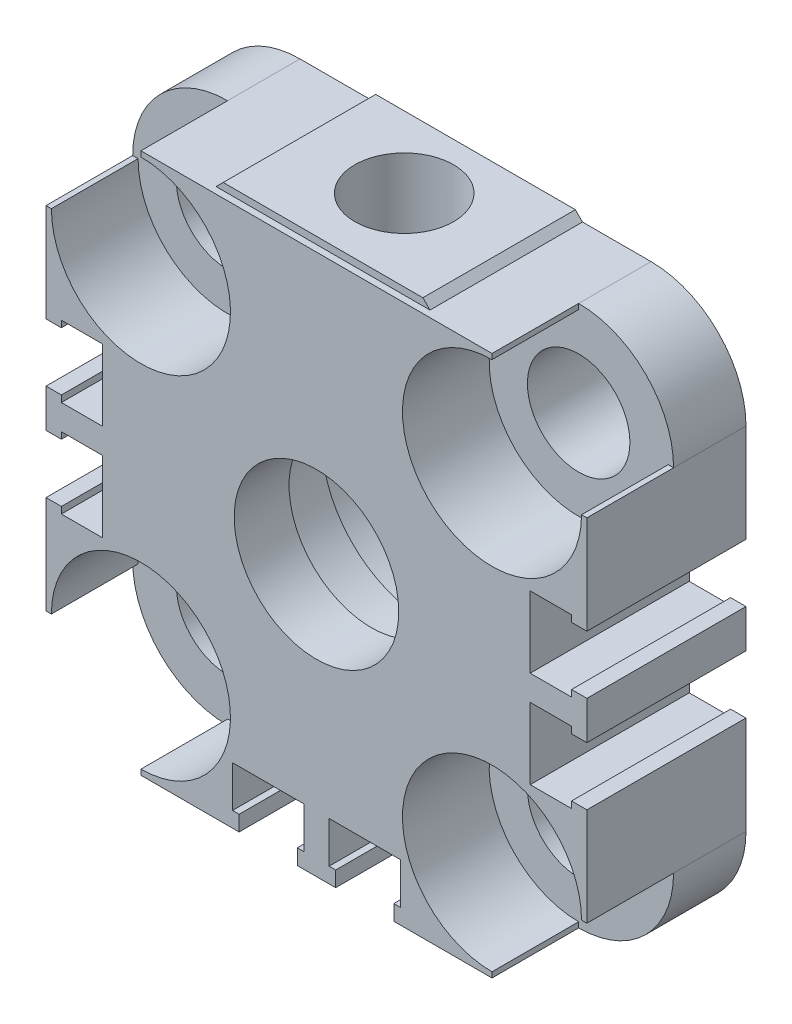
ISO-10303-21;
HEADER;
FILE_DESCRIPTION(('STEP AP214'),'2;1');
FILE_NAME('part.step','',(''),(''),'','','');
FILE_SCHEMA(('AUTOMOTIVE_DESIGN { 1 0 10303 214 1 1 1 1 }'));
ENDSEC;
DATA;
#1=APPLICATION_CONTEXT('core data for automotive mechanical design processes');
#2=APPLICATION_PROTOCOL_DEFINITION('international standard','automotive_design',2000,#1);
#3=PRODUCT_CONTEXT('',#1,'mechanical');
#4=PRODUCT('Part','Part','',(#3));
#5=PRODUCT_RELATED_PRODUCT_CATEGORY('part','',(#4));
#6=PRODUCT_DEFINITION_FORMATION('','',#4);
#7=PRODUCT_DEFINITION_CONTEXT('part definition',#1,'design');
#8=PRODUCT_DEFINITION('design','',#6,#7);
#9=PRODUCT_DEFINITION_SHAPE('','',#8);
#10=(LENGTH_UNIT() NAMED_UNIT(*) SI_UNIT(.MILLI.,.METRE.));
#11=(NAMED_UNIT(*) PLANE_ANGLE_UNIT() SI_UNIT($,.RADIAN.));
#12=(NAMED_UNIT(*) SI_UNIT($,.STERADIAN.) SOLID_ANGLE_UNIT());
#13=UNCERTAINTY_MEASURE_WITH_UNIT(LENGTH_MEASURE(1.E-05),#10,'distance_accuracy_value','');
#14=(GEOMETRIC_REPRESENTATION_CONTEXT(3) GLOBAL_UNCERTAINTY_ASSIGNED_CONTEXT((#13)) GLOBAL_UNIT_ASSIGNED_CONTEXT((#10,
#11,#12)) REPRESENTATION_CONTEXT('',''));
#15=CARTESIAN_POINT('',(0.,0.,0.));
#16=DIRECTION('',(0.,0.,1.));
#17=DIRECTION('',(1.,0.,0.));
#18=AXIS2_PLACEMENT_3D('',#15,#16,#17);
#19=CARTESIAN_POINT('',(0.,0.,-14.5));
#20=DIRECTION('',(0.,0.,1.));
#21=DIRECTION('',(1.,0.,0.));
#22=AXIS2_PLACEMENT_3D('',#19,#20,#21);
#23=CYLINDRICAL_SURFACE('',#22,7.5);
#24=CARTESIAN_POINT('',(0.,0.,0.));
#25=DIRECTION('',(0.,0.,1.));
#26=DIRECTION('',(1.,0.,0.));
#27=AXIS2_PLACEMENT_3D('',#24,#25,#26);
#28=CIRCLE('',#27,7.5);
#29=CARTESIAN_POINT('',(7.5,0.,0.));
#30=VERTEX_POINT('',#29);
#31=EDGE_CURVE('E865',#30,#30,#28,.T.);
#32=CARTESIAN_POINT('',(0.,0.,-5.));
#33=DIRECTION('',(0.,0.,-1.));
#34=DIRECTION('',(-1.,0.,0.));
#35=AXIS2_PLACEMENT_3D('',#32,#33,#34);
#36=CIRCLE('',#35,7.5);
#37=CARTESIAN_POINT('',(7.5,0.,-5.));
#38=VERTEX_POINT('',#37);
#39=EDGE_CURVE('E37',#38,#38,#36,.F.);
#40=CARTESIAN_POINT('',(7.5,0.,0.));
#41=CARTESIAN_POINT('',(7.5,0.,-0.0520833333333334));
#42=CARTESIAN_POINT('',(7.5,0.,-0.104166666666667));
#43=CARTESIAN_POINT('',(7.5,0.,-0.208333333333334));
#44=CARTESIAN_POINT('',(7.5,0.,-0.260416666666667));
#45=CARTESIAN_POINT('',(7.5,0.,-0.364583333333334));
#46=CARTESIAN_POINT('',(7.5,0.,-0.416666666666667));
#47=CARTESIAN_POINT('',(7.5,0.,-0.520833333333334));
#48=CARTESIAN_POINT('',(7.5,0.,-0.572916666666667));
#49=CARTESIAN_POINT('',(7.5,0.,-0.677083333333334));
#50=CARTESIAN_POINT('',(7.5,0.,-0.729166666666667));
#51=CARTESIAN_POINT('',(7.5,0.,-0.833333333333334));
#52=CARTESIAN_POINT('',(7.5,0.,-0.885416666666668));
#53=CARTESIAN_POINT('',(7.5,0.,-0.989583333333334));
#54=CARTESIAN_POINT('',(7.5,0.,-1.04166666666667));
#55=CARTESIAN_POINT('',(7.5,0.,-1.14583333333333));
#56=CARTESIAN_POINT('',(7.5,0.,-1.19791666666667));
#57=CARTESIAN_POINT('',(7.5,0.,-1.30208333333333));
#58=CARTESIAN_POINT('',(7.5,0.,-1.35416666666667));
#59=CARTESIAN_POINT('',(7.5,0.,-1.45833333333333));
#60=CARTESIAN_POINT('',(7.5,0.,-1.51041666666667));
#61=CARTESIAN_POINT('',(7.5,0.,-1.61458333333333));
#62=CARTESIAN_POINT('',(7.5,0.,-1.66666666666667));
#63=CARTESIAN_POINT('',(7.5,0.,-1.77083333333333));
#64=CARTESIAN_POINT('',(7.5,0.,-1.82291666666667));
#65=CARTESIAN_POINT('',(7.5,0.,-1.92708333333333));
#66=CARTESIAN_POINT('',(7.5,0.,-1.97916666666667));
#67=CARTESIAN_POINT('',(7.5,0.,-2.08333333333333));
#68=CARTESIAN_POINT('',(7.5,0.,-2.13541666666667));
#69=CARTESIAN_POINT('',(7.5,0.,-2.23958333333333));
#70=CARTESIAN_POINT('',(7.5,0.,-2.29166666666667));
#71=CARTESIAN_POINT('',(7.5,0.,-2.39583333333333));
#72=CARTESIAN_POINT('',(7.5,0.,-2.44791666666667));
#73=CARTESIAN_POINT('',(7.5,0.,-2.55208333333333));
#74=CARTESIAN_POINT('',(7.5,0.,-2.60416666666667));
#75=CARTESIAN_POINT('',(7.5,0.,-2.70833333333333));
#76=CARTESIAN_POINT('',(7.5,0.,-2.76041666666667));
#77=CARTESIAN_POINT('',(7.5,0.,-2.86458333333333));
#78=CARTESIAN_POINT('',(7.5,0.,-2.91666666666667));
#79=CARTESIAN_POINT('',(7.5,0.,-3.02083333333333));
#80=CARTESIAN_POINT('',(7.5,0.,-3.07291666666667));
#81=CARTESIAN_POINT('',(7.5,0.,-3.17708333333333));
#82=CARTESIAN_POINT('',(7.5,0.,-3.22916666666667));
#83=CARTESIAN_POINT('',(7.5,0.,-3.33333333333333));
#84=CARTESIAN_POINT('',(7.5,0.,-3.38541666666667));
#85=CARTESIAN_POINT('',(7.5,0.,-3.48958333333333));
#86=CARTESIAN_POINT('',(7.5,0.,-3.54166666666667));
#87=CARTESIAN_POINT('',(7.5,0.,-3.64583333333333));
#88=CARTESIAN_POINT('',(7.5,0.,-3.69791666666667));
#89=CARTESIAN_POINT('',(7.5,0.,-3.80208333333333));
#90=CARTESIAN_POINT('',(7.5,0.,-3.85416666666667));
#91=CARTESIAN_POINT('',(7.5,0.,-3.95833333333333));
#92=CARTESIAN_POINT('',(7.5,0.,-4.01041666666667));
#93=CARTESIAN_POINT('',(7.5,0.,-4.11458333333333));
#94=CARTESIAN_POINT('',(7.5,0.,-4.16666666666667));
#95=CARTESIAN_POINT('',(7.5,0.,-4.27083333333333));
#96=CARTESIAN_POINT('',(7.5,0.,-4.32291666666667));
#97=CARTESIAN_POINT('',(7.5,0.,-4.42708333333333));
#98=CARTESIAN_POINT('',(7.5,0.,-4.47916666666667));
#99=CARTESIAN_POINT('',(7.5,0.,-4.58333333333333));
#100=CARTESIAN_POINT('',(7.5,0.,-4.63541666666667));
#101=CARTESIAN_POINT('',(7.5,0.,-4.73958333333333));
#102=CARTESIAN_POINT('',(7.5,0.,-4.79166666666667));
#103=CARTESIAN_POINT('',(7.5,0.,-4.89583333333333));
#104=CARTESIAN_POINT('',(7.5,0.,-4.94791666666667));
#105=CARTESIAN_POINT('',(7.5,0.,-5.));
#106=B_SPLINE_CURVE_WITH_KNOTS('',3,(#40,#41,#42,#43,#44,#45,#46,#47,#48,#49,#50,#51,#52,#53,
#54,#55,#56,#57,#58,#59,#60,#61,#62,#63,#64,#65,#66,#67,#68,#69,#70,#71,#72,#73,#74,#75,#76,#77,
#78,#79,#80,#81,#82,#83,#84,#85,#86,#87,#88,#89,#90,#91,#92,#93,#94,#95,#96,#97,#98,#99,#100,
#101,#102,#103,#104,#105),.UNSPECIFIED.,.F.,.F.,(4,2,2,2,2,2,2,2,2,2,2,2,2,2,2,2,2,2,2,2,2,2,2,
2,2,2,2,2,2,2,2,2,4),(0.,0.15625,0.3125,0.46875,0.625000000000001,0.781250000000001,
0.937500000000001,1.09375,1.25,1.40625,1.5625,1.71875,1.875,2.03125,2.1875,2.34375,2.5,2.65625,
2.8125,2.96875,3.125,3.28125,3.4375,3.59375,3.75,3.90625,4.0625,4.21875,4.375,4.53125,4.6875,
4.84375,5.),.UNSPECIFIED.);
#107=EDGE_CURVE('BSEAM33',#30,#38,#106,.T.);
#108=ORIENTED_EDGE('',*,*,#31,.T.);
#109=ORIENTED_EDGE('',*,*,#39,.F.);
#110=ORIENTED_EDGE('',*,*,#107,.T.);
#111=ORIENTED_EDGE('',*,*,#107,.F.);
#112=EDGE_LOOP('',(#108,#110,#109,#111));
#113=FACE_BOUND('',#112,.T.);
#114=ADVANCED_FACE('F33',(#113),#23,.F.);
#115=CARTESIAN_POINT('',(0.,0.,-15.));
#116=DIRECTION('',(0.,0.,1.));
#117=DIRECTION('',(1.,0.,0.));
#118=AXIS2_PLACEMENT_3D('',#115,#116,#117);
#119=PLANE('',#118);
#120=CARTESIAN_POINT('',(0.,0.,-15.));
#121=DIRECTION('',(0.,0.,1.));
#122=DIRECTION('',(1.,0.,0.));
#123=AXIS2_PLACEMENT_3D('',#120,#121,#122);
#124=CIRCLE('',#123,10.4);
#125=CARTESIAN_POINT('',(10.4,0.,-15.));
#126=VERTEX_POINT('',#125);
#127=EDGE_CURVE('E539',#126,#126,#124,.T.);
#128=ORIENTED_EDGE('',*,*,#127,.T.);
#129=EDGE_LOOP('',(#128));
#130=FACE_BOUND('',#129,.T.);
#131=CARTESIAN_POINT('',(0.,0.,-15.));
#132=DIRECTION('',(0.,0.,1.));
#133=DIRECTION('',(1.,0.,0.));
#134=AXIS2_PLACEMENT_3D('',#131,#132,#133);
#135=CIRCLE('',#134,16.);
#136=CARTESIAN_POINT('',(16.,0.,-15.));
#137=VERTEX_POINT('',#136);
#138=EDGE_CURVE('E545',#137,#137,#135,.T.);
#139=ORIENTED_EDGE('',*,*,#138,.F.);
#140=EDGE_LOOP('',(#139));
#141=FACE_BOUND('',#140,.T.);
#142=CARTESIAN_POINT('',(0.,13.55,-15.));
#143=DIRECTION('',(0.,0.,-1.));
#144=DIRECTION('',(-1.,0.,0.));
#145=AXIS2_PLACEMENT_3D('',#142,#143,#144);
#146=CIRCLE('',#145,0.85);
#147=CARTESIAN_POINT('',(-0.85,13.55,-15.));
#148=VERTEX_POINT('',#147);
#149=EDGE_CURVE('E495',#148,#148,#146,.T.);
#150=ORIENTED_EDGE('',*,*,#149,.F.);
#151=EDGE_LOOP('',(#150));
#152=FACE_BOUND('',#151,.T.);
#153=ADVANCED_FACE('F1121',(#130,#141,#152),#119,.F.);
#154=CARTESIAN_POINT('',(0.,25.3,-8.));
#155=DIRECTION('',(0.,1.,0.));
#156=DIRECTION('',(0.,0.,1.));
#157=AXIS2_PLACEMENT_3D('',#154,#155,#156);
#158=CYLINDRICAL_SURFACE('',#157,4.5);
#159=CARTESIAN_POINT('',(0.,25.3,-8.));
#160=DIRECTION('',(0.,1.,0.));
#161=DIRECTION('',(0.,0.,1.));
#162=AXIS2_PLACEMENT_3D('',#159,#160,#161);
#163=CIRCLE('',#162,4.5);
#164=CARTESIAN_POINT('',(0.,25.3,-3.5));
#165=VERTEX_POINT('',#164);
#166=EDGE_CURVE('E494',#165,#165,#163,.T.);
#167=ORIENTED_EDGE('',*,*,#166,.T.);
#168=EDGE_LOOP('',(#167));
#169=FACE_BOUND('',#168,.T.);
#170=CARTESIAN_POINT('',(0.,12.3,-8.));
#171=DIRECTION('',(0.,1.,0.));
#172=DIRECTION('',(0.,0.,1.));
#173=AXIS2_PLACEMENT_3D('',#170,#171,#172);
#174=CIRCLE('',#173,4.5);
#175=CARTESIAN_POINT('',(0.,12.3,-3.5));
#176=VERTEX_POINT('',#175);
#177=EDGE_CURVE('E492',#176,#176,#174,.T.);
#178=ORIENTED_EDGE('',*,*,#177,.F.);
#179=EDGE_LOOP('',(#178));
#180=FACE_BOUND('',#179,.T.);
#181=CARTESIAN_POINT('',(-0.85,13.55,-12.4189930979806));
#182=CARTESIAN_POINT('',(-0.849998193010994,13.5027143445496,-12.4189940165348));
#183=CARTESIAN_POINT('',(-0.846040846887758,13.4554053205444,-12.4197603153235));
#184=CARTESIAN_POINT('',(-0.830326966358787,13.3621217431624,-12.422738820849));
#185=CARTESIAN_POINT('',(-0.818563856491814,13.3161483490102,-12.4249522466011));
#186=CARTESIAN_POINT('',(-0.787612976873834,13.2268992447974,-12.4305655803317));
#187=CARTESIAN_POINT('',(-0.768432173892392,13.1836210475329,-12.4339643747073));
#188=CARTESIAN_POINT('',(-0.7232089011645,13.1008993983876,-12.4415641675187));
#189=CARTESIAN_POINT('',(-0.6971669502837,13.0614556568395,-12.4457651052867));
#190=CARTESIAN_POINT('',(-0.638610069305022,12.987021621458,-12.4545551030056));
#191=CARTESIAN_POINT('',(-0.606025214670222,12.9520867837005,-12.4591480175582));
#192=CARTESIAN_POINT('',(-0.535458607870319,12.8881455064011,-12.4681704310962));
#193=CARTESIAN_POINT('',(-0.497476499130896,12.8591394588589,-12.4725999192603));
#194=CARTESIAN_POINT('',(-0.416828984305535,12.8076663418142,-12.4808377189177));
#195=CARTESIAN_POINT('',(-0.374129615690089,12.7852516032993,-12.4846409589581));
#196=CARTESIAN_POINT('',(-0.285487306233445,12.7479345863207,-12.4911545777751));
#197=CARTESIAN_POINT('',(-0.239544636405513,12.7330316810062,-12.4938650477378));
#198=CARTESIAN_POINT('',(-0.146294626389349,12.7113329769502,-12.4978605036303));
#199=CARTESIAN_POINT('',(-0.0990097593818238,12.704443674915,-12.4991619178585));
#200=CARTESIAN_POINT('',(-0.00393862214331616,12.6986763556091,-12.5002492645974));
#201=CARTESIAN_POINT('',(0.0438476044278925,12.6997976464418,-12.5000353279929));
#202=CARTESIAN_POINT('',(0.137923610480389,12.7099480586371,-12.4981289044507));
#203=CARTESIAN_POINT('',(0.184224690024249,12.7188764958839,-12.4964552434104));
#204=CARTESIAN_POINT('',(0.274659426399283,12.7442284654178,-12.491838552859));
#205=CARTESIAN_POINT('',(0.318793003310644,12.7606522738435,-12.4888954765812));
#206=CARTESIAN_POINT('',(0.403931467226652,12.8006244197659,-12.4820392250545));
#207=CARTESIAN_POINT('',(0.444917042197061,12.8242129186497,-12.4781206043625));
#208=CARTESIAN_POINT('',(0.522385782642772,12.8778152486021,-12.4697464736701));
#209=CARTESIAN_POINT('',(0.558868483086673,12.9078297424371,-12.4652909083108));
#210=CARTESIAN_POINT('',(0.626892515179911,12.9739866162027,-12.456254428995));
#211=CARTESIAN_POINT('',(0.658348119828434,13.0102170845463,-12.4516726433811));
#212=CARTESIAN_POINT('',(0.714749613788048,13.0874842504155,-12.4429663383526));
#213=CARTESIAN_POINT('',(0.739695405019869,13.128521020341,-12.4388418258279));
#214=CARTESIAN_POINT('',(0.782394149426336,13.2143505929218,-12.4315157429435));
#215=CARTESIAN_POINT('',(0.800134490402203,13.2591498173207,-12.4283157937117));
#216=CARTESIAN_POINT('',(0.827812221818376,13.3511671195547,-12.4232258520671));
#217=CARTESIAN_POINT('',(0.837750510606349,13.3983849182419,-12.4213357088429));
#218=CARTESIAN_POINT('',(0.849416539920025,13.4931255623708,-12.4191092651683));
#219=CARTESIAN_POINT('',(0.851267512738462,13.5406327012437,-12.4187496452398));
#220=CARTESIAN_POINT('',(0.847036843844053,13.6352771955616,-12.4195625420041));
#221=CARTESIAN_POINT('',(0.840955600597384,13.6824145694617,-12.4207349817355));
#222=CARTESIAN_POINT('',(0.8211389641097,13.7745753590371,-12.4244581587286));
#223=CARTESIAN_POINT('',(0.807468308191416,13.8196132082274,-12.4269972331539));
#224=CARTESIAN_POINT('',(0.772929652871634,13.9067591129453,-12.4331575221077));
#225=CARTESIAN_POINT('',(0.752061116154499,13.9488669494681,-12.4367788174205));
#226=CARTESIAN_POINT('',(0.703435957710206,14.0295000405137,-12.444748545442));
#227=CARTESIAN_POINT('',(0.675601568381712,14.0679775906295,-12.4491049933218));
#228=CARTESIAN_POINT('',(0.613939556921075,14.1397605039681,-12.4580316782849));
#229=CARTESIAN_POINT('',(0.580111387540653,14.1730653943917,-12.4626019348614));
#230=CARTESIAN_POINT('',(0.506871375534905,14.2340187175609,-12.471516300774));
#231=CARTESIAN_POINT('',(0.467389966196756,14.261584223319,-12.4758564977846));
#232=CARTESIAN_POINT('',(0.384284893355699,14.3096907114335,-12.4837556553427));
#233=CARTESIAN_POINT('',(0.340661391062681,14.33023196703,-12.4873146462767));
#234=CARTESIAN_POINT('',(0.250738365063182,14.3635830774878,-12.4932335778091));
#235=CARTESIAN_POINT('',(0.20445430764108,14.3764334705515,-12.4955997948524));
#236=CARTESIAN_POINT('',(0.110335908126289,14.3941673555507,-12.4988933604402));
#237=CARTESIAN_POINT('',(0.0625017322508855,14.3990516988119,-12.4998208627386));
#238=CARTESIAN_POINT('',(-0.0325641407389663,14.4006848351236,-12.5001293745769));
#239=CARTESIAN_POINT('',(-0.0797936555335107,14.3975588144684,-12.4995341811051));
#240=CARTESIAN_POINT('',(-0.173041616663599,14.3835343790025,-12.4969136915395));
#241=CARTESIAN_POINT('',(-0.21906007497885,14.3726360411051,-12.4948884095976));
#242=CARTESIAN_POINT('',(-0.30851217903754,14.3434294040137,-12.4896353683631));
#243=CARTESIAN_POINT('',(-0.351950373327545,14.3251346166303,-12.4864098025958));
#244=CARTESIAN_POINT('',(-0.43515912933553,14.281669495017,-12.4791051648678));
#245=CARTESIAN_POINT('',(-0.474929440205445,14.2564986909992,-12.4750260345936));
#246=CARTESIAN_POINT('',(-0.550296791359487,14.1995660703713,-12.4663894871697));
#247=CARTESIAN_POINT('',(-0.585824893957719,14.1677139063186,-12.4618259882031));
#248=CARTESIAN_POINT('',(-0.651075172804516,14.0985100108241,-12.4527731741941));
#249=CARTESIAN_POINT('',(-0.680795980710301,14.0611569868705,-12.448283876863));
#250=CARTESIAN_POINT('',(-0.733851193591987,13.9815909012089,-12.4398415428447));
#251=CARTESIAN_POINT('',(-0.75712284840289,13.9393354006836,-12.4358939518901));
#252=CARTESIAN_POINT('',(-0.796199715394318,13.8514532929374,-12.4290476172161));
#253=CARTESIAN_POINT('',(-0.812011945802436,13.8058299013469,-12.4261478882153));
#254=CARTESIAN_POINT('',(-0.832523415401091,13.7250626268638,-12.4223274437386));
#255=CARTESIAN_POINT('',(-0.839065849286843,13.6903903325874,-12.4210845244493));
#256=CARTESIAN_POINT('',(-0.847804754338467,13.6204830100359,-12.4194170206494));
#257=CARTESIAN_POINT('',(-0.850001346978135,13.5852479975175,-12.4189924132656));
#258=CARTESIAN_POINT('',(-0.85,13.55,-12.4189930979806));
#259=B_SPLINE_CURVE_WITH_KNOTS('',3,(#181,#182,#183,#184,#185,#186,#187,#188,#189,#190,#191,
#192,#193,#194,#195,#196,#197,#198,#199,#200,#201,#202,#203,#204,#205,#206,#207,#208,#209,#210,
#211,#212,#213,#214,#215,#216,#217,#218,#219,#220,#221,#222,#223,#224,#225,#226,#227,#228,#229,
#230,#231,#232,#233,#234,#235,#236,#237,#238,#239,#240,#241,#242,#243,#244,#245,#246,#247,#248,
#249,#250,#251,#252,#253,#254,#255,#256,#257,#258),.UNSPECIFIED.,.T.,.F.,(4,2,2,2,2,2,2,2,2,2,2,
2,2,2,2,2,2,2,2,2,2,2,2,2,2,2,2,2,2,2,2,2,2,2,2,2,2,2,4),(0.,0.141727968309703,
0.283575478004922,0.425290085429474,0.566993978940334,0.71030165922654,0.853618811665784,
0.998044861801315,1.14245885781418,1.28517036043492,1.42786953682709,1.56875510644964,
1.70964586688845,1.85134143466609,1.9930516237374,2.13696697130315,2.28088448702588,
2.42505283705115,2.56920458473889,2.71115195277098,2.85309219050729,2.99383988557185,
3.13459808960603,3.27700390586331,3.41942273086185,3.56377495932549,3.70812157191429,
3.85170048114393,3.99526404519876,4.13659772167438,4.27792999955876,4.41900525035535,
4.5600901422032,4.70322244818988,4.84638843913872,4.99090208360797,5.13527948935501,
5.24093027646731,5.34657811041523),.UNSPECIFIED.);
#260=CARTESIAN_POINT('',(-0.85,13.55,-12.4189930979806));
#261=VERTEX_POINT('',#260);
#262=EDGE_CURVE('E501',#261,#261,#259,.T.);
#263=ORIENTED_EDGE('',*,*,#262,.F.);
#264=EDGE_LOOP('',(#263));
#265=FACE_BOUND('',#264,.T.);
#266=ADVANCED_FACE('F1127',(#169,#180,#265),#158,.F.);
#267=CARTESIAN_POINT('',(16.,16.,-14.5));
#268=DIRECTION('',(0.,0.,-1.));
#269=DIRECTION('',(-1.,0.,0.));
#270=AXIS2_PLACEMENT_3D('',#267,#268,#269);
#271=PLANE('',#270);
#272=CARTESIAN_POINT('',(-16.,16.,-14.5));
#273=DIRECTION('',(0.,0.,-1.));
#274=DIRECTION('',(-1.,0.,0.));
#275=AXIS2_PLACEMENT_3D('',#272,#273,#274);
#276=CIRCLE('',#275,4.67);
#277=CARTESIAN_POINT('',(-20.67,16.,-14.5));
#278=VERTEX_POINT('',#277);
#279=EDGE_CURVE('E992',#278,#278,#276,.T.);
#280=ORIENTED_EDGE('',*,*,#279,.F.);
#281=EDGE_LOOP('',(#280));
#282=FACE_BOUND('',#281,.T.);
#283=CARTESIAN_POINT('',(-16.,-16.,-14.5));
#284=DIRECTION('',(0.,0.,-1.));
#285=DIRECTION('',(-1.,0.,0.));
#286=AXIS2_PLACEMENT_3D('',#283,#284,#285);
#287=CIRCLE('',#286,4.67);
#288=CARTESIAN_POINT('',(-20.67,-16.,-14.5));
#289=VERTEX_POINT('',#288);
#290=EDGE_CURVE('E896',#289,#289,#287,.T.);
#291=ORIENTED_EDGE('',*,*,#290,.F.);
#292=EDGE_LOOP('',(#291));
#293=FACE_BOUND('',#292,.T.);
#294=CARTESIAN_POINT('',(16.0000000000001,-15.9999999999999,-14.5));
#295=DIRECTION('',(0.,0.,-1.));
#296=DIRECTION('',(-1.,0.,0.));
#297=AXIS2_PLACEMENT_3D('',#294,#295,#296);
#298=CIRCLE('',#297,4.67);
#299=CARTESIAN_POINT('',(11.3300000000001,-15.9999999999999,-14.5));
#300=VERTEX_POINT('',#299);
#301=EDGE_CURVE('E890',#300,#300,#298,.T.);
#302=ORIENTED_EDGE('',*,*,#301,.F.);
#303=EDGE_LOOP('',(#302));
#304=FACE_BOUND('',#303,.T.);
#305=CARTESIAN_POINT('',(15.9999999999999,16.0000000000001,-14.5));
#306=DIRECTION('',(0.,0.,-1.));
#307=DIRECTION('',(-1.,0.,0.));
#308=AXIS2_PLACEMENT_3D('',#305,#306,#307);
#309=CIRCLE('',#308,4.67);
#310=CARTESIAN_POINT('',(11.3299999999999,16.0000000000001,-14.5));
#311=VERTEX_POINT('',#310);
#312=EDGE_CURVE('E884',#311,#311,#309,.T.);
#313=ORIENTED_EDGE('',*,*,#312,.F.);
#314=EDGE_LOOP('',(#313));
#315=FACE_BOUND('',#314,.T.);
#316=DIRECTION('',(0.,-1.,0.));
#317=VECTOR('',#316,1.);
#318=CARTESIAN_POINT('',(23.25,1.15000000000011,-14.5));
#319=LINE('',#318,#317);
#320=CARTESIAN_POINT('',(23.25,1.75000000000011,-14.5));
#321=VERTEX_POINT('',#320);
#322=CARTESIAN_POINT('',(23.25,1.15000000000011,-14.5));
#323=VERTEX_POINT('',#322);
#324=EDGE_CURVE('E579',#321,#323,#319,.T.);
#325=ORIENTED_EDGE('',*,*,#324,.F.);
#326=DIRECTION('',(-1.,0.,0.));
#327=VECTOR('',#326,1.);
#328=CARTESIAN_POINT('',(23.25,1.75000000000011,-14.5));
#329=LINE('',#328,#327);
#330=CARTESIAN_POINT('',(24.65,1.75000000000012,-14.5));
#331=VERTEX_POINT('',#330);
#332=EDGE_CURVE('E581',#331,#321,#329,.T.);
#333=ORIENTED_EDGE('',*,*,#332,.F.);
#334=DIRECTION('',(0.,1.,0.));
#335=VECTOR('',#334,1.);
#336=CARTESIAN_POINT('',(24.65,16.,-14.5));
#337=LINE('',#336,#335);
#338=CARTESIAN_POINT('',(24.65,-1.74999999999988,-14.5));
#339=VERTEX_POINT('',#338);
#340=EDGE_CURVE('E1071',#339,#331,#337,.T.);
#341=ORIENTED_EDGE('',*,*,#340,.F.);
#342=DIRECTION('',(-1.,0.,0.));
#343=VECTOR('',#342,1.);
#344=CARTESIAN_POINT('',(23.25,-1.74999999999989,-14.5));
#345=LINE('',#344,#343);
#346=CARTESIAN_POINT('',(23.25,-1.74999999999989,-14.5));
#347=VERTEX_POINT('',#346);
#348=EDGE_CURVE('E672',#339,#347,#345,.T.);
#349=ORIENTED_EDGE('',*,*,#348,.T.);
#350=DIRECTION('',(0.,1.,0.));
#351=VECTOR('',#350,1.);
#352=CARTESIAN_POINT('',(23.25,-1.14999999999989,-14.5));
#353=LINE('',#352,#351);
#354=CARTESIAN_POINT('',(23.25,-1.14999999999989,-14.5));
#355=VERTEX_POINT('',#354);
#356=EDGE_CURVE('E675',#347,#355,#353,.T.);
#357=ORIENTED_EDGE('',*,*,#356,.T.);
#358=DIRECTION('',(-1.,0.,0.));
#359=VECTOR('',#358,1.);
#360=CARTESIAN_POINT('',(19.48,-1.14999999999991,-14.5));
#361=LINE('',#360,#359);
#362=CARTESIAN_POINT('',(19.48,-1.14999999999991,-14.5));
#363=VERTEX_POINT('',#362);
#364=EDGE_CURVE('E678',#355,#363,#361,.T.);
#365=ORIENTED_EDGE('',*,*,#364,.T.);
#366=DIRECTION('',(0.,-1.,0.));
#367=VECTOR('',#366,1.);
#368=CARTESIAN_POINT('',(19.48,-7.64999999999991,-14.5));
#369=LINE('',#368,#367);
#370=CARTESIAN_POINT('',(19.48,-7.64999999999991,-14.5));
#371=VERTEX_POINT('',#370);
#372=EDGE_CURVE('E681',#363,#371,#369,.T.);
#373=ORIENTED_EDGE('',*,*,#372,.T.);
#374=DIRECTION('',(1.,0.,0.));
#375=VECTOR('',#374,1.);
#376=CARTESIAN_POINT('',(23.25,-7.64999999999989,-14.5));
#377=LINE('',#376,#375);
#378=CARTESIAN_POINT('',(23.25,-7.64999999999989,-14.5));
#379=VERTEX_POINT('',#378);
#380=EDGE_CURVE('E684',#371,#379,#377,.T.);
#381=ORIENTED_EDGE('',*,*,#380,.T.);
#382=DIRECTION('',(0.,1.,0.));
#383=VECTOR('',#382,1.);
#384=CARTESIAN_POINT('',(23.25,-7.04999999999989,-14.5));
#385=LINE('',#384,#383);
#386=CARTESIAN_POINT('',(23.25,-7.04999999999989,-14.5));
#387=VERTEX_POINT('',#386);
#388=EDGE_CURVE('E687',#379,#387,#385,.T.);
#389=ORIENTED_EDGE('',*,*,#388,.T.);
#390=DIRECTION('',(1.,0.,0.));
#391=VECTOR('',#390,1.);
#392=CARTESIAN_POINT('',(24.65,-7.04999999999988,-14.5));
#393=LINE('',#392,#391);
#394=CARTESIAN_POINT('',(24.65,-7.04999999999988,-14.5));
#395=VERTEX_POINT('',#394);
#396=EDGE_CURVE('E690',#387,#395,#393,.T.);
#397=ORIENTED_EDGE('',*,*,#396,.T.);
#398=CARTESIAN_POINT('',(24.65,-16.,-14.5));
#399=VERTEX_POINT('',#398);
#400=EDGE_CURVE('E1068',#399,#395,#337,.T.);
#401=ORIENTED_EDGE('',*,*,#400,.F.);
#402=CARTESIAN_POINT('',(16.,-16.,-14.5));
#403=DIRECTION('',(0.,0.,1.));
#404=DIRECTION('',(1.,0.,0.));
#405=AXIS2_PLACEMENT_3D('',#402,#403,#404);
#406=CIRCLE('',#405,8.65);
#407=CARTESIAN_POINT('',(16.,-24.65,-14.5));
#408=VERTEX_POINT('',#407);
#409=EDGE_CURVE('E1063',#408,#399,#406,.T.);
#410=ORIENTED_EDGE('',*,*,#409,.F.);
#411=DIRECTION('',(1.,0.,0.));
#412=VECTOR('',#411,1.);
#413=CARTESIAN_POINT('',(-16.,-24.65,-14.5));
#414=LINE('',#413,#412);
#415=CARTESIAN_POINT('',(7.05000000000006,-24.65,-14.5));
#416=VERTEX_POINT('',#415);
#417=EDGE_CURVE('E1059',#416,#408,#414,.T.);
#418=ORIENTED_EDGE('',*,*,#417,.F.);
#419=DIRECTION('',(0.,-1.,0.));
#420=VECTOR('',#419,1.);
#421=CARTESIAN_POINT('',(7.05000000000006,-24.65,-14.5));
#422=LINE('',#421,#420);
#423=CARTESIAN_POINT('',(7.05000000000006,-23.25,-14.5));
#424=VERTEX_POINT('',#423);
#425=EDGE_CURVE('E621',#424,#416,#422,.T.);
#426=ORIENTED_EDGE('',*,*,#425,.F.);
#427=DIRECTION('',(-1.,0.,0.));
#428=VECTOR('',#427,1.);
#429=CARTESIAN_POINT('',(7.05000000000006,-23.25,-14.5));
#430=LINE('',#429,#428);
#431=CARTESIAN_POINT('',(7.65000000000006,-23.25,-14.5));
#432=VERTEX_POINT('',#431);
#433=EDGE_CURVE('E623',#432,#424,#430,.T.);
#434=ORIENTED_EDGE('',*,*,#433,.F.);
#435=DIRECTION('',(0.,-1.,0.));
#436=VECTOR('',#435,1.);
#437=CARTESIAN_POINT('',(7.65000000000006,-23.25,-14.5));
#438=LINE('',#437,#436);
#439=CARTESIAN_POINT('',(7.65000000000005,-19.48,-14.5));
#440=VERTEX_POINT('',#439);
#441=EDGE_CURVE('E625',#440,#432,#438,.T.);
#442=ORIENTED_EDGE('',*,*,#441,.F.);
#443=DIRECTION('',(1.,0.,0.));
#444=VECTOR('',#443,1.);
#445=CARTESIAN_POINT('',(7.65000000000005,-19.48,-14.5));
#446=LINE('',#445,#444);
#447=CARTESIAN_POINT('',(1.15000000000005,-19.48,-14.5));
#448=VERTEX_POINT('',#447);
#449=EDGE_CURVE('E627',#448,#440,#446,.T.);
#450=ORIENTED_EDGE('',*,*,#449,.F.);
#451=DIRECTION('',(0.,1.,0.));
#452=VECTOR('',#451,1.);
#453=CARTESIAN_POINT('',(1.15000000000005,-19.48,-14.5));
#454=LINE('',#453,#452);
#455=CARTESIAN_POINT('',(1.15000000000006,-23.25,-14.5));
#456=VERTEX_POINT('',#455);
#457=EDGE_CURVE('E629',#456,#448,#454,.T.);
#458=ORIENTED_EDGE('',*,*,#457,.F.);
#459=DIRECTION('',(-1.,0.,0.));
#460=VECTOR('',#459,1.);
#461=CARTESIAN_POINT('',(1.15000000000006,-23.25,-14.5));
#462=LINE('',#461,#460);
#463=CARTESIAN_POINT('',(1.75000000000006,-23.25,-14.5));
#464=VERTEX_POINT('',#463);
#465=EDGE_CURVE('E631',#464,#456,#462,.T.);
#466=ORIENTED_EDGE('',*,*,#465,.F.);
#467=DIRECTION('',(0.,1.,0.));
#468=VECTOR('',#467,1.);
#469=CARTESIAN_POINT('',(1.75000000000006,-23.25,-14.5));
#470=LINE('',#469,#468);
#471=CARTESIAN_POINT('',(1.75000000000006,-24.65,-14.5));
#472=VERTEX_POINT('',#471);
#473=EDGE_CURVE('E633',#472,#464,#470,.T.);
#474=ORIENTED_EDGE('',*,*,#473,.F.);
#475=CARTESIAN_POINT('',(-1.74999999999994,-24.65,-14.5));
#476=VERTEX_POINT('',#475);
#477=EDGE_CURVE('E1064',#476,#472,#414,.T.);
#478=ORIENTED_EDGE('',*,*,#477,.F.);
#479=DIRECTION('',(0.,1.,0.));
#480=VECTOR('',#479,1.);
#481=CARTESIAN_POINT('',(-1.74999999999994,-23.25,-14.5));
#482=LINE('',#481,#480);
#483=CARTESIAN_POINT('',(-1.74999999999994,-23.25,-14.5));
#484=VERTEX_POINT('',#483);
#485=EDGE_CURVE('E730',#476,#484,#482,.T.);
#486=ORIENTED_EDGE('',*,*,#485,.T.);
#487=DIRECTION('',(1.,0.,0.));
#488=VECTOR('',#487,1.);
#489=CARTESIAN_POINT('',(-1.14999999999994,-23.25,-14.5));
#490=LINE('',#489,#488);
#491=CARTESIAN_POINT('',(-1.14999999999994,-23.25,-14.5));
#492=VERTEX_POINT('',#491);
#493=EDGE_CURVE('E733',#484,#492,#490,.T.);
#494=ORIENTED_EDGE('',*,*,#493,.T.);
#495=DIRECTION('',(0.,1.,0.));
#496=VECTOR('',#495,1.);
#497=CARTESIAN_POINT('',(-1.14999999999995,-19.48,-14.5));
#498=LINE('',#497,#496);
#499=CARTESIAN_POINT('',(-1.14999999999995,-19.48,-14.5));
#500=VERTEX_POINT('',#499);
#501=EDGE_CURVE('E736',#492,#500,#498,.T.);
#502=ORIENTED_EDGE('',*,*,#501,.T.);
#503=DIRECTION('',(-1.,0.,0.));
#504=VECTOR('',#503,1.);
#505=CARTESIAN_POINT('',(-7.64999999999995,-19.48,-14.5));
#506=LINE('',#505,#504);
#507=CARTESIAN_POINT('',(-7.64999999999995,-19.48,-14.5));
#508=VERTEX_POINT('',#507);
#509=EDGE_CURVE('E739',#500,#508,#506,.T.);
#510=ORIENTED_EDGE('',*,*,#509,.T.);
#511=DIRECTION('',(0.,-1.,0.));
#512=VECTOR('',#511,1.);
#513=CARTESIAN_POINT('',(-7.64999999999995,-23.25,-14.5));
#514=LINE('',#513,#512);
#515=CARTESIAN_POINT('',(-7.64999999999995,-23.25,-14.5));
#516=VERTEX_POINT('',#515);
#517=EDGE_CURVE('E742',#508,#516,#514,.T.);
#518=ORIENTED_EDGE('',*,*,#517,.T.);
#519=DIRECTION('',(1.,0.,0.));
#520=VECTOR('',#519,1.);
#521=CARTESIAN_POINT('',(-7.04999999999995,-23.25,-14.5));
#522=LINE('',#521,#520);
#523=CARTESIAN_POINT('',(-7.04999999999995,-23.25,-14.5));
#524=VERTEX_POINT('',#523);
#525=EDGE_CURVE('E745',#516,#524,#522,.T.);
#526=ORIENTED_EDGE('',*,*,#525,.T.);
#527=DIRECTION('',(0.,-1.,0.));
#528=VECTOR('',#527,1.);
#529=CARTESIAN_POINT('',(-7.04999999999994,-24.65,-14.5));
#530=LINE('',#529,#528);
#531=CARTESIAN_POINT('',(-7.04999999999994,-24.65,-14.5));
#532=VERTEX_POINT('',#531);
#533=EDGE_CURVE('E748',#524,#532,#530,.T.);
#534=ORIENTED_EDGE('',*,*,#533,.T.);
#535=CARTESIAN_POINT('',(-16.,-24.65,-14.5));
#536=VERTEX_POINT('',#535);
#537=EDGE_CURVE('E1060',#536,#532,#414,.T.);
#538=ORIENTED_EDGE('',*,*,#537,.F.);
#539=CARTESIAN_POINT('',(-16.,-16.,-14.5));
#540=DIRECTION('',(0.,0.,1.));
#541=DIRECTION('',(1.,0.,0.));
#542=AXIS2_PLACEMENT_3D('',#539,#540,#541);
#543=CIRCLE('',#542,8.65);
#544=CARTESIAN_POINT('',(-24.65,-16.,-14.5));
#545=VERTEX_POINT('',#544);
#546=EDGE_CURVE('E1055',#545,#536,#543,.T.);
#547=ORIENTED_EDGE('',*,*,#546,.F.);
#548=DIRECTION('',(0.,-1.,0.));
#549=VECTOR('',#548,1.);
#550=CARTESIAN_POINT('',(-24.65,16.,-14.5));
#551=LINE('',#550,#549);
#552=CARTESIAN_POINT('',(-24.65,-7.05,-14.5));
#553=VERTEX_POINT('',#552);
#554=EDGE_CURVE('E1051',#553,#545,#551,.T.);
#555=ORIENTED_EDGE('',*,*,#554,.F.);
#556=DIRECTION('',(-1.,0.,0.));
#557=VECTOR('',#556,1.);
#558=CARTESIAN_POINT('',(-24.65,-7.05,-14.5));
#559=LINE('',#558,#557);
#560=CARTESIAN_POINT('',(-23.25,-7.05,-14.5));
#561=VERTEX_POINT('',#560);
#562=EDGE_CURVE('E789',#561,#553,#559,.T.);
#563=ORIENTED_EDGE('',*,*,#562,.F.);
#564=DIRECTION('',(0.,1.,0.));
#565=VECTOR('',#564,1.);
#566=CARTESIAN_POINT('',(-23.25,-7.05,-14.5));
#567=LINE('',#566,#565);
#568=CARTESIAN_POINT('',(-23.25,-7.65,-14.5));
#569=VERTEX_POINT('',#568);
#570=EDGE_CURVE('E791',#569,#561,#567,.T.);
#571=ORIENTED_EDGE('',*,*,#570,.F.);
#572=DIRECTION('',(-1.,0.,0.));
#573=VECTOR('',#572,1.);
#574=CARTESIAN_POINT('',(-23.25,-7.65,-14.5));
#575=LINE('',#574,#573);
#576=CARTESIAN_POINT('',(-19.48,-7.65,-14.5));
#577=VERTEX_POINT('',#576);
#578=EDGE_CURVE('E793',#577,#569,#575,.T.);
#579=ORIENTED_EDGE('',*,*,#578,.F.);
#580=DIRECTION('',(0.,-1.,0.));
#581=VECTOR('',#580,1.);
#582=CARTESIAN_POINT('',(-19.48,-7.65,-14.5));
#583=LINE('',#582,#581);
#584=CARTESIAN_POINT('',(-19.48,-1.15,-14.5));
#585=VERTEX_POINT('',#584);
#586=EDGE_CURVE('E795',#585,#577,#583,.T.);
#587=ORIENTED_EDGE('',*,*,#586,.F.);
#588=DIRECTION('',(1.,0.,0.));
#589=VECTOR('',#588,1.);
#590=CARTESIAN_POINT('',(-19.48,-1.15,-14.5));
#591=LINE('',#590,#589);
#592=CARTESIAN_POINT('',(-23.25,-1.15,-14.5));
#593=VERTEX_POINT('',#592);
#594=EDGE_CURVE('E797',#593,#585,#591,.T.);
#595=ORIENTED_EDGE('',*,*,#594,.F.);
#596=DIRECTION('',(0.,1.,0.));
#597=VECTOR('',#596,1.);
#598=CARTESIAN_POINT('',(-23.25,-1.15,-14.5));
#599=LINE('',#598,#597);
#600=CARTESIAN_POINT('',(-23.25,-1.75,-14.5));
#601=VERTEX_POINT('',#600);
#602=EDGE_CURVE('E799',#601,#593,#599,.T.);
#603=ORIENTED_EDGE('',*,*,#602,.F.);
#604=DIRECTION('',(1.,0.,0.));
#605=VECTOR('',#604,1.);
#606=CARTESIAN_POINT('',(-23.25,-1.75,-14.5));
#607=LINE('',#606,#605);
#608=CARTESIAN_POINT('',(-24.65,-1.75,-14.5));
#609=VERTEX_POINT('',#608);
#610=EDGE_CURVE('E801',#609,#601,#607,.T.);
#611=ORIENTED_EDGE('',*,*,#610,.F.);
#612=CARTESIAN_POINT('',(-24.65,1.75,-14.5));
#613=VERTEX_POINT('',#612);
#614=EDGE_CURVE('E1056',#613,#609,#551,.T.);
#615=ORIENTED_EDGE('',*,*,#614,.F.);
#616=DIRECTION('',(1.,0.,0.));
#617=VECTOR('',#616,1.);
#618=CARTESIAN_POINT('',(-23.25,1.75,-14.5));
#619=LINE('',#618,#617);
#620=CARTESIAN_POINT('',(-23.25,1.75,-14.5));
#621=VERTEX_POINT('',#620);
#622=EDGE_CURVE('E840',#613,#621,#619,.T.);
#623=ORIENTED_EDGE('',*,*,#622,.T.);
#624=DIRECTION('',(0.,-1.,0.));
#625=VECTOR('',#624,1.);
#626=CARTESIAN_POINT('',(-23.25,1.15,-14.5));
#627=LINE('',#626,#625);
#628=CARTESIAN_POINT('',(-23.25,1.15,-14.5));
#629=VERTEX_POINT('',#628);
#630=EDGE_CURVE('E843',#621,#629,#627,.T.);
#631=ORIENTED_EDGE('',*,*,#630,.T.);
#632=DIRECTION('',(1.,0.,0.));
#633=VECTOR('',#632,1.);
#634=CARTESIAN_POINT('',(-19.48,1.15,-14.5));
#635=LINE('',#634,#633);
#636=CARTESIAN_POINT('',(-19.48,1.15,-14.5));
#637=VERTEX_POINT('',#636);
#638=EDGE_CURVE('E846',#629,#637,#635,.T.);
#639=ORIENTED_EDGE('',*,*,#638,.T.);
#640=DIRECTION('',(0.,1.,0.));
#641=VECTOR('',#640,1.);
#642=CARTESIAN_POINT('',(-19.48,7.65,-14.5));
#643=LINE('',#642,#641);
#644=CARTESIAN_POINT('',(-19.48,7.65,-14.5));
#645=VERTEX_POINT('',#644);
#646=EDGE_CURVE('E849',#637,#645,#643,.T.);
#647=ORIENTED_EDGE('',*,*,#646,.T.);
#648=DIRECTION('',(-1.,0.,0.));
#649=VECTOR('',#648,1.);
#650=CARTESIAN_POINT('',(-23.25,7.65,-14.5));
#651=LINE('',#650,#649);
#652=CARTESIAN_POINT('',(-23.25,7.65,-14.5));
#653=VERTEX_POINT('',#652);
#654=EDGE_CURVE('E852',#645,#653,#651,.T.);
#655=ORIENTED_EDGE('',*,*,#654,.T.);
#656=DIRECTION('',(0.,-1.,0.));
#657=VECTOR('',#656,1.);
#658=CARTESIAN_POINT('',(-23.25,7.05,-14.5));
#659=LINE('',#658,#657);
#660=CARTESIAN_POINT('',(-23.25,7.05,-14.5));
#661=VERTEX_POINT('',#660);
#662=EDGE_CURVE('E855',#653,#661,#659,.T.);
#663=ORIENTED_EDGE('',*,*,#662,.T.);
#664=DIRECTION('',(-1.,0.,0.));
#665=VECTOR('',#664,1.);
#666=CARTESIAN_POINT('',(-24.65,7.05,-14.5));
#667=LINE('',#666,#665);
#668=CARTESIAN_POINT('',(-24.65,7.05,-14.5));
#669=VERTEX_POINT('',#668);
#670=EDGE_CURVE('E858',#661,#669,#667,.T.);
#671=ORIENTED_EDGE('',*,*,#670,.T.);
#672=CARTESIAN_POINT('',(-24.65,16.,-14.5));
#673=VERTEX_POINT('',#672);
#674=EDGE_CURVE('E1052',#673,#669,#551,.T.);
#675=ORIENTED_EDGE('',*,*,#674,.F.);
#676=CARTESIAN_POINT('',(-16.,16.,-14.5));
#677=DIRECTION('',(0.,0.,1.));
#678=DIRECTION('',(1.,0.,0.));
#679=AXIS2_PLACEMENT_3D('',#676,#677,#678);
#680=CIRCLE('',#679,8.65);
#681=CARTESIAN_POINT('',(-16.,24.65,-14.5));
#682=VERTEX_POINT('',#681);
#683=EDGE_CURVE('E1048',#682,#673,#680,.T.);
#684=ORIENTED_EDGE('',*,*,#683,.F.);
#685=DIRECTION('',(-1.,0.,0.));
#686=VECTOR('',#685,1.);
#687=CARTESIAN_POINT('',(-16.,24.65,-14.5));
#688=LINE('',#687,#686);
#689=CARTESIAN_POINT('',(-9.75,24.65,-14.5));
#690=VERTEX_POINT('',#689);
#691=EDGE_CURVE('E1045',#690,#682,#688,.T.);
#692=ORIENTED_EDGE('',*,*,#691,.F.);
#693=DIRECTION('',(0.707106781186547,0.707106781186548,0.));
#694=VECTOR('',#693,1.);
#695=CARTESIAN_POINT('',(-9.1,25.3,-14.5));
#696=LINE('',#695,#694);
#697=CARTESIAN_POINT('',(-9.1,25.3,-14.5));
#698=VERTEX_POINT('',#697);
#699=EDGE_CURVE('E498',#690,#698,#696,.T.);
#700=ORIENTED_EDGE('',*,*,#699,.T.);
#701=DIRECTION('',(1.,0.,0.));
#702=VECTOR('',#701,1.);
#703=CARTESIAN_POINT('',(9.1,25.3,-14.5));
#704=LINE('',#703,#702);
#705=CARTESIAN_POINT('',(9.1,25.3,-14.5));
#706=VERTEX_POINT('',#705);
#707=EDGE_CURVE('E507',#698,#706,#704,.T.);
#708=ORIENTED_EDGE('',*,*,#707,.T.);
#709=DIRECTION('',(0.707106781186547,-0.707106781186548,0.));
#710=VECTOR('',#709,1.);
#711=CARTESIAN_POINT('',(9.75,24.65,-14.5));
#712=LINE('',#711,#710);
#713=CARTESIAN_POINT('',(9.75,24.65,-14.5));
#714=VERTEX_POINT('',#713);
#715=EDGE_CURVE('E510',#706,#714,#712,.T.);
#716=ORIENTED_EDGE('',*,*,#715,.T.);
#717=CARTESIAN_POINT('',(16.,24.65,-14.5));
#718=VERTEX_POINT('',#717);
#719=EDGE_CURVE('E1046',#718,#714,#688,.T.);
#720=ORIENTED_EDGE('',*,*,#719,.F.);
#721=CARTESIAN_POINT('',(16.,16.,-14.5));
#722=DIRECTION('',(0.,0.,1.));
#723=DIRECTION('',(-1.,0.,0.));
#724=AXIS2_PLACEMENT_3D('',#721,#722,#723);
#725=CIRCLE('',#724,8.65);
#726=CARTESIAN_POINT('',(24.65,16.,-14.5));
#727=VERTEX_POINT('',#726);
#728=EDGE_CURVE('E1041',#727,#718,#725,.T.);
#729=ORIENTED_EDGE('',*,*,#728,.F.);
#730=CARTESIAN_POINT('',(24.65,7.05000000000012,-14.5));
#731=VERTEX_POINT('',#730);
#732=EDGE_CURVE('E1067',#731,#727,#337,.T.);
#733=ORIENTED_EDGE('',*,*,#732,.F.);
#734=DIRECTION('',(1.,0.,0.));
#735=VECTOR('',#734,1.);
#736=CARTESIAN_POINT('',(24.65,7.05000000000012,-14.5));
#737=LINE('',#736,#735);
#738=CARTESIAN_POINT('',(23.25,7.05000000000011,-14.5));
#739=VERTEX_POINT('',#738);
#740=EDGE_CURVE('E569',#739,#731,#737,.T.);
#741=ORIENTED_EDGE('',*,*,#740,.F.);
#742=DIRECTION('',(0.,-1.,0.));
#743=VECTOR('',#742,1.);
#744=CARTESIAN_POINT('',(23.25,7.05000000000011,-14.5));
#745=LINE('',#744,#743);
#746=CARTESIAN_POINT('',(23.25,7.65000000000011,-14.5));
#747=VERTEX_POINT('',#746);
#748=EDGE_CURVE('E571',#747,#739,#745,.T.);
#749=ORIENTED_EDGE('',*,*,#748,.F.);
#750=DIRECTION('',(1.,0.,0.));
#751=VECTOR('',#750,1.);
#752=CARTESIAN_POINT('',(23.25,7.65000000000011,-14.5));
#753=LINE('',#752,#751);
#754=CARTESIAN_POINT('',(19.48,7.65000000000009,-14.5));
#755=VERTEX_POINT('',#754);
#756=EDGE_CURVE('E573',#755,#747,#753,.T.);
#757=ORIENTED_EDGE('',*,*,#756,.F.);
#758=DIRECTION('',(0.,1.,0.));
#759=VECTOR('',#758,1.);
#760=CARTESIAN_POINT('',(19.48,7.65000000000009,-14.5));
#761=LINE('',#760,#759);
#762=CARTESIAN_POINT('',(19.48,1.15000000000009,-14.5));
#763=VERTEX_POINT('',#762);
#764=EDGE_CURVE('E575',#763,#755,#761,.T.);
#765=ORIENTED_EDGE('',*,*,#764,.F.);
#766=DIRECTION('',(-1.,0.,0.));
#767=VECTOR('',#766,1.);
#768=CARTESIAN_POINT('',(19.48,1.15000000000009,-14.5));
#769=LINE('',#768,#767);
#770=EDGE_CURVE('E577',#323,#763,#769,.T.);
#771=ORIENTED_EDGE('',*,*,#770,.F.);
#772=EDGE_LOOP('',(#325,#333,#341,#349,#357,#365,#373,#381,#389,#397,#401,#410,#418,#426,#434,
#442,#450,#458,#466,#474,#478,#486,#494,#502,#510,#518,#526,#534,#538,#547,#555,#563,#571,#579,
#587,#595,#603,#611,#615,#623,#631,#639,#647,#655,#663,#671,#675,#684,#692,#700,#708,#716,#720,
#729,#733,#741,#749,#757,#765,#771));
#773=FACE_BOUND('',#772,.T.);
#774=CARTESIAN_POINT('',(0.,0.,-14.5));
#775=DIRECTION('',(0.,0.,1.));
#776=DIRECTION('',(1.,0.,0.));
#777=AXIS2_PLACEMENT_3D('',#774,#775,#776);
#778=CIRCLE('',#777,17.25);
#779=CARTESIAN_POINT('',(17.25,0.,-14.5));
#780=VERTEX_POINT('',#779);
#781=EDGE_CURVE('E533',#780,#780,#778,.T.);
#782=ORIENTED_EDGE('',*,*,#781,.T.);
#783=EDGE_LOOP('',(#782));
#784=FACE_BOUND('',#783,.T.);
#785=ADVANCED_FACE('F1221',(#282,#293,#304,#315,#773,#784),#271,.T.);
#786=CARTESIAN_POINT('',(16.,16.,0.));
#787=DIRECTION('',(0.,0.,-1.));
#788=DIRECTION('',(-1.,0.,0.));
#789=AXIS2_PLACEMENT_3D('',#786,#787,#788);
#790=PLANE('',#789);
#791=ORIENTED_EDGE('',*,*,#31,.F.);
#792=EDGE_LOOP('',(#791));
#793=FACE_BOUND('',#792,.T.);
#794=DIRECTION('',(-1.,0.,0.));
#795=VECTOR('',#794,1.);
#796=CARTESIAN_POINT('',(23.25,1.75000000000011,0.));
#797=LINE('',#796,#795);
#798=CARTESIAN_POINT('',(24.65,1.75000000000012,0.));
#799=VERTEX_POINT('',#798);
#800=CARTESIAN_POINT('',(23.25,1.75000000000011,0.));
#801=VERTEX_POINT('',#800);
#802=EDGE_CURVE('E566',#799,#801,#797,.T.);
#803=ORIENTED_EDGE('',*,*,#802,.T.);
#804=DIRECTION('',(0.,-1.,0.));
#805=VECTOR('',#804,1.);
#806=CARTESIAN_POINT('',(23.25,1.15000000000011,0.));
#807=LINE('',#806,#805);
#808=CARTESIAN_POINT('',(23.25,1.15000000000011,0.));
#809=VERTEX_POINT('',#808);
#810=EDGE_CURVE('E563',#801,#809,#807,.T.);
#811=ORIENTED_EDGE('',*,*,#810,.T.);
#812=DIRECTION('',(-1.,0.,0.));
#813=VECTOR('',#812,1.);
#814=CARTESIAN_POINT('',(19.48,1.15000000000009,0.));
#815=LINE('',#814,#813);
#816=CARTESIAN_POINT('',(19.48,1.15000000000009,0.));
#817=VERTEX_POINT('',#816);
#818=EDGE_CURVE('E560',#809,#817,#815,.T.);
#819=ORIENTED_EDGE('',*,*,#818,.T.);
#820=DIRECTION('',(0.,1.,0.));
#821=VECTOR('',#820,1.);
#822=CARTESIAN_POINT('',(19.48,7.65000000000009,0.));
#823=LINE('',#822,#821);
#824=CARTESIAN_POINT('',(19.48,7.65000000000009,0.));
#825=VERTEX_POINT('',#824);
#826=EDGE_CURVE('E557',#817,#825,#823,.T.);
#827=ORIENTED_EDGE('',*,*,#826,.T.);
#828=DIRECTION('',(1.,0.,0.));
#829=VECTOR('',#828,1.);
#830=CARTESIAN_POINT('',(23.25,7.65000000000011,0.));
#831=LINE('',#830,#829);
#832=CARTESIAN_POINT('',(23.25,7.65000000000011,0.));
#833=VERTEX_POINT('',#832);
#834=EDGE_CURVE('E554',#825,#833,#831,.T.);
#835=ORIENTED_EDGE('',*,*,#834,.T.);
#836=DIRECTION('',(0.,-1.,0.));
#837=VECTOR('',#836,1.);
#838=CARTESIAN_POINT('',(23.25,7.05000000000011,0.));
#839=LINE('',#838,#837);
#840=CARTESIAN_POINT('',(23.25,7.05000000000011,0.));
#841=VERTEX_POINT('',#840);
#842=EDGE_CURVE('E551',#833,#841,#839,.T.);
#843=ORIENTED_EDGE('',*,*,#842,.T.);
#844=DIRECTION('',(1.,0.,0.));
#845=VECTOR('',#844,1.);
#846=CARTESIAN_POINT('',(24.65,7.05000000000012,0.));
#847=LINE('',#846,#845);
#848=CARTESIAN_POINT('',(24.65,7.05000000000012,0.));
#849=VERTEX_POINT('',#848);
#850=EDGE_CURVE('E548',#841,#849,#847,.T.);
#851=ORIENTED_EDGE('',*,*,#850,.T.);
#852=DIRECTION('',(0.,1.,0.));
#853=VECTOR('',#852,1.);
#854=CARTESIAN_POINT('',(24.65,16.,0.));
#855=LINE('',#854,#853);
#856=CARTESIAN_POINT('',(24.6499999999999,16.0000000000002,0.));
#857=VERTEX_POINT('',#856);
#858=EDGE_CURVE('E1036',#849,#857,#855,.T.);
#859=ORIENTED_EDGE('',*,*,#858,.T.);
#860=DIRECTION('',(1.,0.,0.));
#861=VECTOR('',#860,1.);
#862=CARTESIAN_POINT('',(24.1599999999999,16.0000000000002,0.));
#863=LINE('',#862,#861);
#864=CARTESIAN_POINT('',(24.1599999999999,16.0000000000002,0.));
#865=VERTEX_POINT('',#864);
#866=EDGE_CURVE('E905',#865,#857,#863,.T.);
#867=ORIENTED_EDGE('',*,*,#866,.F.);
#868=CARTESIAN_POINT('',(15.9999999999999,16.0000000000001,0.));
#869=DIRECTION('',(0.,0.,1.));
#870=DIRECTION('',(0.,-1.,0.));
#871=AXIS2_PLACEMENT_3D('',#868,#869,#870);
#872=CIRCLE('',#871,8.16);
#873=CARTESIAN_POINT('',(15.9999999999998,24.1600000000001,0.));
#874=VERTEX_POINT('',#873);
#875=EDGE_CURVE('E902',#874,#865,#872,.T.);
#876=ORIENTED_EDGE('',*,*,#875,.F.);
#877=DIRECTION('',(0.,-1.,0.));
#878=VECTOR('',#877,1.);
#879=CARTESIAN_POINT('',(15.9999999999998,24.1600000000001,0.));
#880=LINE('',#879,#878);
#881=CARTESIAN_POINT('',(16.,24.65,0.));
#882=VERTEX_POINT('',#881);
#883=EDGE_CURVE('E899',#882,#874,#880,.T.);
#884=ORIENTED_EDGE('',*,*,#883,.F.);
#885=DIRECTION('',(-1.,0.,0.));
#886=VECTOR('',#885,1.);
#887=CARTESIAN_POINT('',(-16.,24.65,0.));
#888=LINE('',#887,#886);
#889=CARTESIAN_POINT('',(-16.,24.65,0.));
#890=VERTEX_POINT('',#889);
#891=EDGE_CURVE('E1019',#882,#890,#888,.T.);
#892=ORIENTED_EDGE('',*,*,#891,.T.);
#893=DIRECTION('',(0.,1.,0.));
#894=VECTOR('',#893,1.);
#895=CARTESIAN_POINT('',(-16.,24.16,0.));
#896=LINE('',#895,#894);
#897=CARTESIAN_POINT('',(-16.,24.16,0.));
#898=VERTEX_POINT('',#897);
#899=EDGE_CURVE('E1001',#898,#890,#896,.T.);
#900=ORIENTED_EDGE('',*,*,#899,.F.);
#901=CARTESIAN_POINT('',(-16.,16.,0.));
#902=DIRECTION('',(0.,0.,1.));
#903=DIRECTION('',(1.,0.,0.));
#904=AXIS2_PLACEMENT_3D('',#901,#902,#903);
#905=CIRCLE('',#904,8.16);
#906=CARTESIAN_POINT('',(-24.16,16.,0.));
#907=VERTEX_POINT('',#906);
#908=EDGE_CURVE('E998',#907,#898,#905,.T.);
#909=ORIENTED_EDGE('',*,*,#908,.F.);
#910=DIRECTION('',(1.,0.,0.));
#911=VECTOR('',#910,1.);
#912=CARTESIAN_POINT('',(-24.16,16.,0.));
#913=LINE('',#912,#911);
#914=CARTESIAN_POINT('',(-24.65,16.,0.));
#915=VERTEX_POINT('',#914);
#916=EDGE_CURVE('E995',#915,#907,#913,.T.);
#917=ORIENTED_EDGE('',*,*,#916,.F.);
#918=DIRECTION('',(0.,-1.,0.));
#919=VECTOR('',#918,1.);
#920=CARTESIAN_POINT('',(-24.65,16.,0.));
#921=LINE('',#920,#919);
#922=CARTESIAN_POINT('',(-24.65,7.05,0.));
#923=VERTEX_POINT('',#922);
#924=EDGE_CURVE('E1028',#915,#923,#921,.T.);
#925=ORIENTED_EDGE('',*,*,#924,.T.);
#926=DIRECTION('',(-1.,0.,0.));
#927=VECTOR('',#926,1.);
#928=CARTESIAN_POINT('',(-24.65,7.05,0.));
#929=LINE('',#928,#927);
#930=CARTESIAN_POINT('',(-23.25,7.05,0.));
#931=VERTEX_POINT('',#930);
#932=EDGE_CURVE('E838',#931,#923,#929,.T.);
#933=ORIENTED_EDGE('',*,*,#932,.F.);
#934=DIRECTION('',(0.,-1.,0.));
#935=VECTOR('',#934,1.);
#936=CARTESIAN_POINT('',(-23.25,7.05,0.));
#937=LINE('',#936,#935);
#938=CARTESIAN_POINT('',(-23.25,7.65,0.));
#939=VERTEX_POINT('',#938);
#940=EDGE_CURVE('E835',#939,#931,#937,.T.);
#941=ORIENTED_EDGE('',*,*,#940,.F.);
#942=DIRECTION('',(-1.,0.,0.));
#943=VECTOR('',#942,1.);
#944=CARTESIAN_POINT('',(-23.25,7.65,0.));
#945=LINE('',#944,#943);
#946=CARTESIAN_POINT('',(-19.48,7.65,0.));
#947=VERTEX_POINT('',#946);
#948=EDGE_CURVE('E832',#947,#939,#945,.T.);
#949=ORIENTED_EDGE('',*,*,#948,.F.);
#950=DIRECTION('',(0.,1.,0.));
#951=VECTOR('',#950,1.);
#952=CARTESIAN_POINT('',(-19.48,7.65,0.));
#953=LINE('',#952,#951);
#954=CARTESIAN_POINT('',(-19.48,1.15,0.));
#955=VERTEX_POINT('',#954);
#956=EDGE_CURVE('E829',#955,#947,#953,.T.);
#957=ORIENTED_EDGE('',*,*,#956,.F.);
#958=DIRECTION('',(1.,0.,0.));
#959=VECTOR('',#958,1.);
#960=CARTESIAN_POINT('',(-19.48,1.15,0.));
#961=LINE('',#960,#959);
#962=CARTESIAN_POINT('',(-23.25,1.15,0.));
#963=VERTEX_POINT('',#962);
#964=EDGE_CURVE('E826',#963,#955,#961,.T.);
#965=ORIENTED_EDGE('',*,*,#964,.F.);
#966=DIRECTION('',(0.,-1.,0.));
#967=VECTOR('',#966,1.);
#968=CARTESIAN_POINT('',(-23.25,1.15,0.));
#969=LINE('',#968,#967);
#970=CARTESIAN_POINT('',(-23.25,1.75,0.));
#971=VERTEX_POINT('',#970);
#972=EDGE_CURVE('E823',#971,#963,#969,.T.);
#973=ORIENTED_EDGE('',*,*,#972,.F.);
#974=DIRECTION('',(1.,0.,0.));
#975=VECTOR('',#974,1.);
#976=CARTESIAN_POINT('',(-23.25,1.75,0.));
#977=LINE('',#976,#975);
#978=CARTESIAN_POINT('',(-24.65,1.75,0.));
#979=VERTEX_POINT('',#978);
#980=EDGE_CURVE('E807',#979,#971,#977,.T.);
#981=ORIENTED_EDGE('',*,*,#980,.F.);
#982=CARTESIAN_POINT('',(-24.65,-1.75,0.));
#983=VERTEX_POINT('',#982);
#984=EDGE_CURVE('E1032',#979,#983,#921,.T.);
#985=ORIENTED_EDGE('',*,*,#984,.T.);
#986=DIRECTION('',(1.,0.,0.));
#987=VECTOR('',#986,1.);
#988=CARTESIAN_POINT('',(-23.25,-1.75,0.));
#989=LINE('',#988,#987);
#990=CARTESIAN_POINT('',(-23.25,-1.75,0.));
#991=VERTEX_POINT('',#990);
#992=EDGE_CURVE('E786',#983,#991,#989,.T.);
#993=ORIENTED_EDGE('',*,*,#992,.T.);
#994=DIRECTION('',(0.,1.,0.));
#995=VECTOR('',#994,1.);
#996=CARTESIAN_POINT('',(-23.25,-1.15,0.));
#997=LINE('',#996,#995);
#998=CARTESIAN_POINT('',(-23.25,-1.15,0.));
#999=VERTEX_POINT('',#998);
#1000=EDGE_CURVE('E783',#991,#999,#997,.T.);
#1001=ORIENTED_EDGE('',*,*,#1000,.T.);
#1002=DIRECTION('',(1.,0.,0.));
#1003=VECTOR('',#1002,1.);
#1004=CARTESIAN_POINT('',(-19.48,-1.15,0.));
#1005=LINE('',#1004,#1003);
#1006=CARTESIAN_POINT('',(-19.48,-1.15,0.));
#1007=VERTEX_POINT('',#1006);
#1008=EDGE_CURVE('E780',#999,#1007,#1005,.T.);
#1009=ORIENTED_EDGE('',*,*,#1008,.T.);
#1010=DIRECTION('',(0.,-1.,0.));
#1011=VECTOR('',#1010,1.);
#1012=CARTESIAN_POINT('',(-19.48,-7.65,0.));
#1013=LINE('',#1012,#1011);
#1014=CARTESIAN_POINT('',(-19.48,-7.65,0.));
#1015=VERTEX_POINT('',#1014);
#1016=EDGE_CURVE('E777',#1007,#1015,#1013,.T.);
#1017=ORIENTED_EDGE('',*,*,#1016,.T.);
#1018=DIRECTION('',(-1.,0.,0.));
#1019=VECTOR('',#1018,1.);
#1020=CARTESIAN_POINT('',(-23.25,-7.65,0.));
#1021=LINE('',#1020,#1019);
#1022=CARTESIAN_POINT('',(-23.25,-7.65,0.));
#1023=VERTEX_POINT('',#1022);
#1024=EDGE_CURVE('E774',#1015,#1023,#1021,.T.);
#1025=ORIENTED_EDGE('',*,*,#1024,.T.);
#1026=DIRECTION('',(0.,1.,0.));
#1027=VECTOR('',#1026,1.);
#1028=CARTESIAN_POINT('',(-23.25,-7.05,0.));
#1029=LINE('',#1028,#1027);
#1030=CARTESIAN_POINT('',(-23.25,-7.05,0.));
#1031=VERTEX_POINT('',#1030);
#1032=EDGE_CURVE('E771',#1023,#1031,#1029,.T.);
#1033=ORIENTED_EDGE('',*,*,#1032,.T.);
#1034=DIRECTION('',(-1.,0.,0.));
#1035=VECTOR('',#1034,1.);
#1036=CARTESIAN_POINT('',(-24.65,-7.05,0.));
#1037=LINE('',#1036,#1035);
#1038=CARTESIAN_POINT('',(-24.65,-7.05,0.));
#1039=VERTEX_POINT('',#1038);
#1040=EDGE_CURVE('E755',#1031,#1039,#1037,.T.);
#1041=ORIENTED_EDGE('',*,*,#1040,.T.);
#1042=CARTESIAN_POINT('',(-24.65,-16.0000000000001,0.));
#1043=VERTEX_POINT('',#1042);
#1044=EDGE_CURVE('E1027',#1039,#1043,#921,.T.);
#1045=ORIENTED_EDGE('',*,*,#1044,.T.);
#1046=DIRECTION('',(-1.,0.,0.));
#1047=VECTOR('',#1046,1.);
#1048=CARTESIAN_POINT('',(-24.16,-16.0000000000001,0.));
#1049=LINE('',#1048,#1047);
#1050=CARTESIAN_POINT('',(-24.16,-16.0000000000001,0.));
#1051=VERTEX_POINT('',#1050);
#1052=EDGE_CURVE('E965',#1051,#1043,#1049,.T.);
#1053=ORIENTED_EDGE('',*,*,#1052,.F.);
#1054=CARTESIAN_POINT('',(-16.,-16.,0.));
#1055=DIRECTION('',(0.,0.,1.));
#1056=DIRECTION('',(0.,1.,0.));
#1057=AXIS2_PLACEMENT_3D('',#1054,#1055,#1056);
#1058=CIRCLE('',#1057,8.16);
#1059=CARTESIAN_POINT('',(-15.9999999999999,-24.16,0.));
#1060=VERTEX_POINT('',#1059);
#1061=EDGE_CURVE('E962',#1060,#1051,#1058,.T.);
#1062=ORIENTED_EDGE('',*,*,#1061,.F.);
#1063=DIRECTION('',(0.,1.,0.));
#1064=VECTOR('',#1063,1.);
#1065=CARTESIAN_POINT('',(-15.9999999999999,-24.16,0.));
#1066=LINE('',#1065,#1064);
#1067=CARTESIAN_POINT('',(-16.,-24.65,0.));
#1068=VERTEX_POINT('',#1067);
#1069=EDGE_CURVE('E954',#1068,#1060,#1066,.T.);
#1070=ORIENTED_EDGE('',*,*,#1069,.F.);
#1071=DIRECTION('',(1.,0.,0.));
#1072=VECTOR('',#1071,1.);
#1073=CARTESIAN_POINT('',(-16.,-24.65,0.));
#1074=LINE('',#1073,#1072);
#1075=CARTESIAN_POINT('',(-7.04999999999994,-24.65,0.));
#1076=VERTEX_POINT('',#1075);
#1077=EDGE_CURVE('E1033',#1068,#1076,#1074,.T.);
#1078=ORIENTED_EDGE('',*,*,#1077,.T.);
#1079=DIRECTION('',(0.,-1.,0.));
#1080=VECTOR('',#1079,1.);
#1081=CARTESIAN_POINT('',(-7.04999999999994,-24.65,0.));
#1082=LINE('',#1081,#1080);
#1083=CARTESIAN_POINT('',(-7.04999999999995,-23.25,0.));
#1084=VERTEX_POINT('',#1083);
#1085=EDGE_CURVE('E728',#1084,#1076,#1082,.T.);
#1086=ORIENTED_EDGE('',*,*,#1085,.F.);
#1087=DIRECTION('',(1.,0.,0.));
#1088=VECTOR('',#1087,1.);
#1089=CARTESIAN_POINT('',(-7.04999999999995,-23.25,0.));
#1090=LINE('',#1089,#1088);
#1091=CARTESIAN_POINT('',(-7.64999999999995,-23.25,0.));
#1092=VERTEX_POINT('',#1091);
#1093=EDGE_CURVE('E725',#1092,#1084,#1090,.T.);
#1094=ORIENTED_EDGE('',*,*,#1093,.F.);
#1095=DIRECTION('',(0.,-1.,0.));
#1096=VECTOR('',#1095,1.);
#1097=CARTESIAN_POINT('',(-7.64999999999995,-23.25,0.));
#1098=LINE('',#1097,#1096);
#1099=CARTESIAN_POINT('',(-7.64999999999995,-19.48,0.));
#1100=VERTEX_POINT('',#1099);
#1101=EDGE_CURVE('E722',#1100,#1092,#1098,.T.);
#1102=ORIENTED_EDGE('',*,*,#1101,.F.);
#1103=DIRECTION('',(-1.,0.,0.));
#1104=VECTOR('',#1103,1.);
#1105=CARTESIAN_POINT('',(-7.64999999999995,-19.48,0.));
#1106=LINE('',#1105,#1104);
#1107=CARTESIAN_POINT('',(-1.14999999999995,-19.48,0.));
#1108=VERTEX_POINT('',#1107);
#1109=EDGE_CURVE('E719',#1108,#1100,#1106,.T.);
#1110=ORIENTED_EDGE('',*,*,#1109,.F.);
#1111=DIRECTION('',(0.,1.,0.));
#1112=VECTOR('',#1111,1.);
#1113=CARTESIAN_POINT('',(-1.14999999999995,-19.48,0.));
#1114=LINE('',#1113,#1112);
#1115=CARTESIAN_POINT('',(-1.14999999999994,-23.25,0.));
#1116=VERTEX_POINT('',#1115);
#1117=EDGE_CURVE('E716',#1116,#1108,#1114,.T.);
#1118=ORIENTED_EDGE('',*,*,#1117,.F.);
#1119=DIRECTION('',(1.,0.,0.));
#1120=VECTOR('',#1119,1.);
#1121=CARTESIAN_POINT('',(-1.14999999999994,-23.25,0.));
#1122=LINE('',#1121,#1120);
#1123=CARTESIAN_POINT('',(-1.74999999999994,-23.25,0.));
#1124=VERTEX_POINT('',#1123);
#1125=EDGE_CURVE('E713',#1124,#1116,#1122,.T.);
#1126=ORIENTED_EDGE('',*,*,#1125,.F.);
#1127=DIRECTION('',(0.,1.,0.));
#1128=VECTOR('',#1127,1.);
#1129=CARTESIAN_POINT('',(-1.74999999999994,-23.25,0.));
#1130=LINE('',#1129,#1128);
#1131=CARTESIAN_POINT('',(-1.74999999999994,-24.65,0.));
#1132=VERTEX_POINT('',#1131);
#1133=EDGE_CURVE('E697',#1132,#1124,#1130,.T.);
#1134=ORIENTED_EDGE('',*,*,#1133,.F.);
#1135=CARTESIAN_POINT('',(1.75000000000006,-24.65,0.));
#1136=VERTEX_POINT('',#1135);
#1137=EDGE_CURVE('E1037',#1132,#1136,#1074,.T.);
#1138=ORIENTED_EDGE('',*,*,#1137,.T.);
#1139=DIRECTION('',(0.,1.,0.));
#1140=VECTOR('',#1139,1.);
#1141=CARTESIAN_POINT('',(1.75000000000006,-23.25,0.));
#1142=LINE('',#1141,#1140);
#1143=CARTESIAN_POINT('',(1.75000000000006,-23.25,0.));
#1144=VERTEX_POINT('',#1143);
#1145=EDGE_CURVE('E618',#1136,#1144,#1142,.T.);
#1146=ORIENTED_EDGE('',*,*,#1145,.T.);
#1147=DIRECTION('',(-1.,0.,0.));
#1148=VECTOR('',#1147,1.);
#1149=CARTESIAN_POINT('',(1.15000000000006,-23.25,0.));
#1150=LINE('',#1149,#1148);
#1151=CARTESIAN_POINT('',(1.15000000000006,-23.25,0.));
#1152=VERTEX_POINT('',#1151);
#1153=EDGE_CURVE('E615',#1144,#1152,#1150,.T.);
#1154=ORIENTED_EDGE('',*,*,#1153,.T.);
#1155=DIRECTION('',(0.,1.,0.));
#1156=VECTOR('',#1155,1.);
#1157=CARTESIAN_POINT('',(1.15000000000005,-19.48,0.));
#1158=LINE('',#1157,#1156);
#1159=CARTESIAN_POINT('',(1.15000000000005,-19.48,0.));
#1160=VERTEX_POINT('',#1159);
#1161=EDGE_CURVE('E612',#1152,#1160,#1158,.T.);
#1162=ORIENTED_EDGE('',*,*,#1161,.T.);
#1163=DIRECTION('',(1.,0.,0.));
#1164=VECTOR('',#1163,1.);
#1165=CARTESIAN_POINT('',(7.65000000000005,-19.48,0.));
#1166=LINE('',#1165,#1164);
#1167=CARTESIAN_POINT('',(7.65000000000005,-19.48,0.));
#1168=VERTEX_POINT('',#1167);
#1169=EDGE_CURVE('E609',#1160,#1168,#1166,.T.);
#1170=ORIENTED_EDGE('',*,*,#1169,.T.);
#1171=DIRECTION('',(0.,-1.,0.));
#1172=VECTOR('',#1171,1.);
#1173=CARTESIAN_POINT('',(7.65000000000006,-23.25,0.));
#1174=LINE('',#1173,#1172);
#1175=CARTESIAN_POINT('',(7.65000000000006,-23.25,0.));
#1176=VERTEX_POINT('',#1175);
#1177=EDGE_CURVE('E606',#1168,#1176,#1174,.T.);
#1178=ORIENTED_EDGE('',*,*,#1177,.T.);
#1179=DIRECTION('',(-1.,0.,0.));
#1180=VECTOR('',#1179,1.);
#1181=CARTESIAN_POINT('',(7.05000000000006,-23.25,0.));
#1182=LINE('',#1181,#1180);
#1183=CARTESIAN_POINT('',(7.05000000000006,-23.25,0.));
#1184=VERTEX_POINT('',#1183);
#1185=EDGE_CURVE('E603',#1176,#1184,#1182,.T.);
#1186=ORIENTED_EDGE('',*,*,#1185,.T.);
#1187=DIRECTION('',(0.,-1.,0.));
#1188=VECTOR('',#1187,1.);
#1189=CARTESIAN_POINT('',(7.05000000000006,-24.65,0.));
#1190=LINE('',#1189,#1188);
#1191=CARTESIAN_POINT('',(7.05000000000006,-24.65,0.));
#1192=VERTEX_POINT('',#1191);
#1193=EDGE_CURVE('E587',#1184,#1192,#1190,.T.);
#1194=ORIENTED_EDGE('',*,*,#1193,.T.);
#1195=CARTESIAN_POINT('',(16.0000000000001,-24.6499999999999,0.));
#1196=VERTEX_POINT('',#1195);
#1197=EDGE_CURVE('E1031',#1192,#1196,#1074,.T.);
#1198=ORIENTED_EDGE('',*,*,#1197,.T.);
#1199=DIRECTION('',(0.,-1.,0.));
#1200=VECTOR('',#1199,1.);
#1201=CARTESIAN_POINT('',(16.0000000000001,-24.1599999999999,0.));
#1202=LINE('',#1201,#1200);
#1203=CARTESIAN_POINT('',(16.0000000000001,-24.1599999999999,0.));
#1204=VERTEX_POINT('',#1203);
#1205=EDGE_CURVE('E935',#1204,#1196,#1202,.T.);
#1206=ORIENTED_EDGE('',*,*,#1205,.F.);
#1207=CARTESIAN_POINT('',(16.0000000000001,-15.9999999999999,0.));
#1208=DIRECTION('',(0.,0.,1.));
#1209=DIRECTION('',(-1.,0.,0.));
#1210=AXIS2_PLACEMENT_3D('',#1207,#1208,#1209);
#1211=CIRCLE('',#1210,8.16);
#1212=CARTESIAN_POINT('',(24.1600000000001,-15.9999999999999,0.));
#1213=VERTEX_POINT('',#1212);
#1214=EDGE_CURVE('E932',#1213,#1204,#1211,.T.);
#1215=ORIENTED_EDGE('',*,*,#1214,.F.);
#1216=DIRECTION('',(-1.,0.,0.));
#1217=VECTOR('',#1216,1.);
#1218=CARTESIAN_POINT('',(24.1600000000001,-15.9999999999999,0.));
#1219=LINE('',#1218,#1217);
#1220=CARTESIAN_POINT('',(24.65,-16.,0.));
#1221=VERTEX_POINT('',#1220);
#1222=EDGE_CURVE('E924',#1221,#1213,#1219,.T.);
#1223=ORIENTED_EDGE('',*,*,#1222,.F.);
#1224=CARTESIAN_POINT('',(24.65,-7.04999999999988,0.));
#1225=VERTEX_POINT('',#1224);
#1226=EDGE_CURVE('E1038',#1221,#1225,#855,.T.);
#1227=ORIENTED_EDGE('',*,*,#1226,.T.);
#1228=DIRECTION('',(1.,0.,0.));
#1229=VECTOR('',#1228,1.);
#1230=CARTESIAN_POINT('',(24.65,-7.04999999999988,0.));
#1231=LINE('',#1230,#1229);
#1232=CARTESIAN_POINT('',(23.25,-7.04999999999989,0.));
#1233=VERTEX_POINT('',#1232);
#1234=EDGE_CURVE('E670',#1233,#1225,#1231,.T.);
#1235=ORIENTED_EDGE('',*,*,#1234,.F.);
#1236=DIRECTION('',(0.,1.,0.));
#1237=VECTOR('',#1236,1.);
#1238=CARTESIAN_POINT('',(23.25,-7.04999999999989,0.));
#1239=LINE('',#1238,#1237);
#1240=CARTESIAN_POINT('',(23.25,-7.64999999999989,0.));
#1241=VERTEX_POINT('',#1240);
#1242=EDGE_CURVE('E667',#1241,#1233,#1239,.T.);
#1243=ORIENTED_EDGE('',*,*,#1242,.F.);
#1244=DIRECTION('',(1.,0.,0.));
#1245=VECTOR('',#1244,1.);
#1246=CARTESIAN_POINT('',(23.25,-7.64999999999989,0.));
#1247=LINE('',#1246,#1245);
#1248=CARTESIAN_POINT('',(19.48,-7.64999999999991,0.));
#1249=VERTEX_POINT('',#1248);
#1250=EDGE_CURVE('E664',#1249,#1241,#1247,.T.);
#1251=ORIENTED_EDGE('',*,*,#1250,.F.);
#1252=DIRECTION('',(0.,-1.,0.));
#1253=VECTOR('',#1252,1.);
#1254=CARTESIAN_POINT('',(19.48,-7.64999999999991,0.));
#1255=LINE('',#1254,#1253);
#1256=CARTESIAN_POINT('',(19.48,-1.14999999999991,0.));
#1257=VERTEX_POINT('',#1256);
#1258=EDGE_CURVE('E661',#1257,#1249,#1255,.T.);
#1259=ORIENTED_EDGE('',*,*,#1258,.F.);
#1260=DIRECTION('',(-1.,0.,0.));
#1261=VECTOR('',#1260,1.);
#1262=CARTESIAN_POINT('',(19.48,-1.14999999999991,0.));
#1263=LINE('',#1262,#1261);
#1264=CARTESIAN_POINT('',(23.25,-1.14999999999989,0.));
#1265=VERTEX_POINT('',#1264);
#1266=EDGE_CURVE('E658',#1265,#1257,#1263,.T.);
#1267=ORIENTED_EDGE('',*,*,#1266,.F.);
#1268=DIRECTION('',(0.,1.,0.));
#1269=VECTOR('',#1268,1.);
#1270=CARTESIAN_POINT('',(23.25,-1.14999999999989,0.));
#1271=LINE('',#1270,#1269);
#1272=CARTESIAN_POINT('',(23.25,-1.74999999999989,0.));
#1273=VERTEX_POINT('',#1272);
#1274=EDGE_CURVE('E655',#1273,#1265,#1271,.T.);
#1275=ORIENTED_EDGE('',*,*,#1274,.F.);
#1276=DIRECTION('',(-1.,0.,0.));
#1277=VECTOR('',#1276,1.);
#1278=CARTESIAN_POINT('',(23.25,-1.74999999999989,0.));
#1279=LINE('',#1278,#1277);
#1280=CARTESIAN_POINT('',(24.65,-1.74999999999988,0.));
#1281=VERTEX_POINT('',#1280);
#1282=EDGE_CURVE('E639',#1281,#1273,#1279,.T.);
#1283=ORIENTED_EDGE('',*,*,#1282,.F.);
#1284=EDGE_CURVE('E1042',#1281,#799,#855,.T.);
#1285=ORIENTED_EDGE('',*,*,#1284,.T.);
#1286=EDGE_LOOP('',(#803,#811,#819,#827,#835,#843,#851,#859,#867,#876,#884,#892,#900,#909,#917,
#925,#933,#941,#949,#957,#965,#973,#981,#985,#993,#1001,#1009,#1017,#1025,#1033,#1041,#1045,
#1053,#1062,#1070,#1078,#1086,#1094,#1102,#1110,#1118,#1126,#1134,#1138,#1146,#1154,#1162,#1170,
#1178,#1186,#1194,#1198,#1206,#1215,#1223,#1227,#1235,#1243,#1251,#1259,#1267,#1275,#1283,#1285));
#1287=FACE_BOUND('',#1286,.T.);
#1288=ADVANCED_FACE('F1217',(#793,#1287),#790,.F.);
#1289=CARTESIAN_POINT('',(24.65,16.,-14.5));
#1290=DIRECTION('',(1.,0.,0.));
#1291=DIRECTION('',(0.,0.,-1.));
#1292=AXIS2_PLACEMENT_3D('',#1289,#1290,#1291);
#1293=PLANE('',#1292);
#1294=ORIENTED_EDGE('',*,*,#340,.T.);
#1295=DIRECTION('',(0.,0.,1.));
#1296=VECTOR('',#1295,1.);
#1297=CARTESIAN_POINT('',(24.65,1.75000000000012,-14.5));
#1298=LINE('',#1297,#1296);
#1299=EDGE_CURVE('E584',#331,#799,#1298,.T.);
#1300=ORIENTED_EDGE('',*,*,#1299,.T.);
#1301=ORIENTED_EDGE('',*,*,#1284,.F.);
#1302=DIRECTION('',(0.,0.,1.));
#1303=VECTOR('',#1302,1.);
#1304=CARTESIAN_POINT('',(24.65,-1.74999999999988,-14.5));
#1305=LINE('',#1304,#1303);
#1306=EDGE_CURVE('E693',#339,#1281,#1305,.T.);
#1307=ORIENTED_EDGE('',*,*,#1306,.F.);
#1308=EDGE_LOOP('',(#1294,#1300,#1301,#1307));
#1309=FACE_BOUND('',#1308,.T.);
#1310=ADVANCED_FACE('F1220',(#1309),#1293,.T.);
#1311=ORIENTED_EDGE('',*,*,#858,.F.);
#1312=DIRECTION('',(0.,0.,1.));
#1313=VECTOR('',#1312,1.);
#1314=CARTESIAN_POINT('',(24.65,7.05000000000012,-14.5));
#1315=LINE('',#1314,#1313);
#1316=EDGE_CURVE('E583',#731,#849,#1315,.T.);
#1317=ORIENTED_EDGE('',*,*,#1316,.F.);
#1318=ORIENTED_EDGE('',*,*,#732,.T.);
#1319=DIRECTION('',(0.,0.,1.));
#1320=VECTOR('',#1319,1.);
#1321=CARTESIAN_POINT('',(24.65,16.,-14.5));
#1322=LINE('',#1321,#1320);
#1323=CARTESIAN_POINT('',(24.6499999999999,16.0000000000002,-7.9));
#1324=VERTEX_POINT('',#1323);
#1325=EDGE_CURVE('E11',#727,#1324,#1322,.T.);
#1326=ORIENTED_EDGE('',*,*,#1325,.T.);
#1327=DIRECTION('',(0.,0.,1.));
#1328=VECTOR('',#1327,1.);
#1329=CARTESIAN_POINT('',(24.6499999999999,16.0000000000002,-7.9));
#1330=LINE('',#1329,#1328);
#1331=EDGE_CURVE('E921',#1324,#857,#1330,.T.);
#1332=ORIENTED_EDGE('',*,*,#1331,.T.);
#1333=EDGE_LOOP('',(#1311,#1317,#1318,#1326,#1332));
#1334=FACE_BOUND('',#1333,.T.);
#1335=ADVANCED_FACE('F1228',(#1334),#1293,.T.);
#1336=CARTESIAN_POINT('',(-16.,-24.65,-14.5));
#1337=DIRECTION('',(0.,-1.,0.));
#1338=DIRECTION('',(0.,0.,-1.));
#1339=AXIS2_PLACEMENT_3D('',#1336,#1337,#1338);
#1340=PLANE('',#1339);
#1341=ORIENTED_EDGE('',*,*,#477,.T.);
#1342=DIRECTION('',(0.,0.,1.));
#1343=VECTOR('',#1342,1.);
#1344=CARTESIAN_POINT('',(1.75000000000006,-24.65,-14.5));
#1345=LINE('',#1344,#1343);
#1346=EDGE_CURVE('E636',#472,#1136,#1345,.T.);
#1347=ORIENTED_EDGE('',*,*,#1346,.T.);
#1348=ORIENTED_EDGE('',*,*,#1137,.F.);
#1349=DIRECTION('',(0.,0.,1.));
#1350=VECTOR('',#1349,1.);
#1351=CARTESIAN_POINT('',(-1.74999999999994,-24.65,-14.5));
#1352=LINE('',#1351,#1350);
#1353=EDGE_CURVE('E751',#476,#1132,#1352,.T.);
#1354=ORIENTED_EDGE('',*,*,#1353,.F.);
#1355=EDGE_LOOP('',(#1341,#1347,#1348,#1354));
#1356=FACE_BOUND('',#1355,.T.);
#1357=ADVANCED_FACE('F1236',(#1356),#1340,.T.);
#1358=ORIENTED_EDGE('',*,*,#1197,.F.);
#1359=DIRECTION('',(0.,0.,1.));
#1360=VECTOR('',#1359,1.);
#1361=CARTESIAN_POINT('',(7.05000000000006,-24.65,-14.5));
#1362=LINE('',#1361,#1360);
#1363=EDGE_CURVE('E635',#416,#1192,#1362,.T.);
#1364=ORIENTED_EDGE('',*,*,#1363,.F.);
#1365=ORIENTED_EDGE('',*,*,#417,.T.);
#1366=DIRECTION('',(0.,0.,1.));
#1367=VECTOR('',#1366,1.);
#1368=CARTESIAN_POINT('',(16.,-24.65,-14.5));
#1369=LINE('',#1368,#1367);
#1370=CARTESIAN_POINT('',(16.0000000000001,-24.6499999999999,-7.9));
#1371=VERTEX_POINT('',#1370);
#1372=EDGE_CURVE('E1075',#408,#1371,#1369,.T.);
#1373=ORIENTED_EDGE('',*,*,#1372,.T.);
#1374=DIRECTION('',(0.,0.,1.));
#1375=VECTOR('',#1374,1.);
#1376=CARTESIAN_POINT('',(16.0000000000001,-24.6499999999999,-7.9));
#1377=LINE('',#1376,#1375);
#1378=EDGE_CURVE('E951',#1371,#1196,#1377,.T.);
#1379=ORIENTED_EDGE('',*,*,#1378,.T.);
#1380=EDGE_LOOP('',(#1358,#1364,#1365,#1373,#1379));
#1381=FACE_BOUND('',#1380,.T.);
#1382=ADVANCED_FACE('F1239',(#1381),#1340,.T.);
#1383=DIRECTION('',(0.,0.,1.));
#1384=VECTOR('',#1383,1.);
#1385=CARTESIAN_POINT('',(24.65,-7.04999999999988,-14.5));
#1386=LINE('',#1385,#1384);
#1387=EDGE_CURVE('E694',#395,#1225,#1386,.T.);
#1388=ORIENTED_EDGE('',*,*,#1387,.T.);
#1389=ORIENTED_EDGE('',*,*,#1226,.F.);
#1390=DIRECTION('',(0.,0.,1.));
#1391=VECTOR('',#1390,1.);
#1392=CARTESIAN_POINT('',(24.6500000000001,-15.9999999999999,-7.9));
#1393=LINE('',#1392,#1391);
#1394=CARTESIAN_POINT('',(24.6500000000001,-15.9999999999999,-7.9));
#1395=VERTEX_POINT('',#1394);
#1396=EDGE_CURVE('E950',#1395,#1221,#1393,.T.);
#1397=ORIENTED_EDGE('',*,*,#1396,.F.);
#1398=DIRECTION('',(0.,0.,1.));
#1399=VECTOR('',#1398,1.);
#1400=CARTESIAN_POINT('',(24.65,-16.,-14.5));
#1401=LINE('',#1400,#1399);
#1402=EDGE_CURVE('E42',#399,#1395,#1401,.T.);
#1403=ORIENTED_EDGE('',*,*,#1402,.F.);
#1404=ORIENTED_EDGE('',*,*,#400,.T.);
#1405=EDGE_LOOP('',(#1388,#1389,#1397,#1403,#1404));
#1406=FACE_BOUND('',#1405,.T.);
#1407=ADVANCED_FACE('F1230',(#1406),#1293,.T.);
#1408=DIRECTION('',(0.,0.,1.));
#1409=VECTOR('',#1408,1.);
#1410=CARTESIAN_POINT('',(-7.04999999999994,-24.65,-14.5));
#1411=LINE('',#1410,#1409);
#1412=EDGE_CURVE('E752',#532,#1076,#1411,.T.);
#1413=ORIENTED_EDGE('',*,*,#1412,.T.);
#1414=ORIENTED_EDGE('',*,*,#1077,.F.);
#1415=DIRECTION('',(0.,0.,1.));
#1416=VECTOR('',#1415,1.);
#1417=CARTESIAN_POINT('',(-15.9999999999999,-24.65,-7.9));
#1418=LINE('',#1417,#1416);
#1419=CARTESIAN_POINT('',(-15.9999999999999,-24.65,-7.9));
#1420=VERTEX_POINT('',#1419);
#1421=EDGE_CURVE('E980',#1420,#1068,#1418,.T.);
#1422=ORIENTED_EDGE('',*,*,#1421,.F.);
#1423=DIRECTION('',(0.,0.,1.));
#1424=VECTOR('',#1423,1.);
#1425=CARTESIAN_POINT('',(-16.,-24.65,-14.5));
#1426=LINE('',#1425,#1424);
#1427=EDGE_CURVE('E1078',#536,#1420,#1426,.T.);
#1428=ORIENTED_EDGE('',*,*,#1427,.F.);
#1429=ORIENTED_EDGE('',*,*,#537,.T.);
#1430=EDGE_LOOP('',(#1413,#1414,#1422,#1428,#1429));
#1431=FACE_BOUND('',#1430,.T.);
#1432=ADVANCED_FACE('F1241',(#1431),#1340,.T.);
#1433=CARTESIAN_POINT('',(-24.65,16.,-14.5));
#1434=DIRECTION('',(-1.,0.,0.));
#1435=DIRECTION('',(0.,0.,1.));
#1436=AXIS2_PLACEMENT_3D('',#1433,#1434,#1435);
#1437=PLANE('',#1436);
#1438=ORIENTED_EDGE('',*,*,#614,.T.);
#1439=DIRECTION('',(0.,0.,1.));
#1440=VECTOR('',#1439,1.);
#1441=CARTESIAN_POINT('',(-24.65,-1.75,-14.5));
#1442=LINE('',#1441,#1440);
#1443=EDGE_CURVE('E804',#609,#983,#1442,.T.);
#1444=ORIENTED_EDGE('',*,*,#1443,.T.);
#1445=ORIENTED_EDGE('',*,*,#984,.F.);
#1446=DIRECTION('',(0.,0.,1.));
#1447=VECTOR('',#1446,1.);
#1448=CARTESIAN_POINT('',(-24.65,1.75,-14.5));
#1449=LINE('',#1448,#1447);
#1450=EDGE_CURVE('E861',#613,#979,#1449,.T.);
#1451=ORIENTED_EDGE('',*,*,#1450,.F.);
#1452=EDGE_LOOP('',(#1438,#1444,#1445,#1451));
#1453=FACE_BOUND('',#1452,.T.);
#1454=ADVANCED_FACE('F1246',(#1453),#1437,.T.);
#1455=ORIENTED_EDGE('',*,*,#1044,.F.);
#1456=DIRECTION('',(0.,0.,1.));
#1457=VECTOR('',#1456,1.);
#1458=CARTESIAN_POINT('',(-24.65,-7.05,-14.5));
#1459=LINE('',#1458,#1457);
#1460=EDGE_CURVE('E803',#553,#1039,#1459,.T.);
#1461=ORIENTED_EDGE('',*,*,#1460,.F.);
#1462=ORIENTED_EDGE('',*,*,#554,.T.);
#1463=DIRECTION('',(0.,0.,1.));
#1464=VECTOR('',#1463,1.);
#1465=CARTESIAN_POINT('',(-24.65,-16.,-14.5));
#1466=LINE('',#1465,#1464);
#1467=CARTESIAN_POINT('',(-24.65,-16.0000000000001,-7.9));
#1468=VERTEX_POINT('',#1467);
#1469=EDGE_CURVE('E1081',#545,#1468,#1466,.T.);
#1470=ORIENTED_EDGE('',*,*,#1469,.T.);
#1471=DIRECTION('',(0.,0.,1.));
#1472=VECTOR('',#1471,1.);
#1473=CARTESIAN_POINT('',(-24.65,-16.0000000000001,-7.9));
#1474=LINE('',#1473,#1472);
#1475=EDGE_CURVE('E981',#1468,#1043,#1474,.T.);
#1476=ORIENTED_EDGE('',*,*,#1475,.T.);
#1477=EDGE_LOOP('',(#1455,#1461,#1462,#1470,#1476));
#1478=FACE_BOUND('',#1477,.T.);
#1479=ADVANCED_FACE('F1249',(#1478),#1437,.T.);
#1480=DIRECTION('',(0.,0.,1.));
#1481=VECTOR('',#1480,1.);
#1482=CARTESIAN_POINT('',(-24.65,7.05,-14.5));
#1483=LINE('',#1482,#1481);
#1484=EDGE_CURVE('E862',#669,#923,#1483,.T.);
#1485=ORIENTED_EDGE('',*,*,#1484,.T.);
#1486=ORIENTED_EDGE('',*,*,#924,.F.);
#1487=DIRECTION('',(0.,0.,1.));
#1488=VECTOR('',#1487,1.);
#1489=CARTESIAN_POINT('',(-24.65,16.,-7.9));
#1490=LINE('',#1489,#1488);
#1491=CARTESIAN_POINT('',(-24.65,16.,-7.9));
#1492=VERTEX_POINT('',#1491);
#1493=EDGE_CURVE('E1015',#1492,#915,#1490,.T.);
#1494=ORIENTED_EDGE('',*,*,#1493,.F.);
#1495=DIRECTION('',(0.,0.,1.));
#1496=VECTOR('',#1495,1.);
#1497=CARTESIAN_POINT('',(-24.65,16.,-14.5));
#1498=LINE('',#1497,#1496);
#1499=EDGE_CURVE('E1084',#673,#1492,#1498,.T.);
#1500=ORIENTED_EDGE('',*,*,#1499,.F.);
#1501=ORIENTED_EDGE('',*,*,#674,.T.);
#1502=EDGE_LOOP('',(#1485,#1486,#1494,#1500,#1501));
#1503=FACE_BOUND('',#1502,.T.);
#1504=ADVANCED_FACE('F1251',(#1503),#1437,.T.);
#1505=CARTESIAN_POINT('',(16.,16.,-14.5));
#1506=DIRECTION('',(0.,0.,1.));
#1507=DIRECTION('',(1.,0.,0.));
#1508=AXIS2_PLACEMENT_3D('',#1505,#1506,#1507);
#1509=CYLINDRICAL_SURFACE('',#1508,8.65);
#1510=DIRECTION('',(0.,0.,1.));
#1511=VECTOR('',#1510,1.);
#1512=CARTESIAN_POINT('',(16.,24.65,-14.5));
#1513=LINE('',#1512,#1511);
#1514=CARTESIAN_POINT('',(15.9999999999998,24.6500000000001,-7.9));
#1515=VERTEX_POINT('',#1514);
#1516=EDGE_CURVE('E1070',#718,#1515,#1513,.T.);
#1517=ORIENTED_EDGE('',*,*,#1516,.T.);
#1518=CARTESIAN_POINT('',(15.9999999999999,16.0000000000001,-7.9));
#1519=DIRECTION('',(0.,0.,1.));
#1520=DIRECTION('',(0.,-1.,0.));
#1521=AXIS2_PLACEMENT_3D('',#1518,#1519,#1520);
#1522=CIRCLE('',#1521,8.65);
#1523=EDGE_CURVE('E908',#1324,#1515,#1522,.T.);
#1524=ORIENTED_EDGE('',*,*,#1523,.F.);
#1525=ORIENTED_EDGE('',*,*,#1325,.F.);
#1526=ORIENTED_EDGE('',*,*,#728,.T.);
#1527=EDGE_LOOP('',(#1517,#1524,#1525,#1526));
#1528=FACE_BOUND('',#1527,.T.);
#1529=ADVANCED_FACE('F35',(#1528),#1509,.T.);
#1530=CARTESIAN_POINT('',(16.,-16.,-14.5));
#1531=DIRECTION('',(0.,0.,1.));
#1532=DIRECTION('',(1.,0.,0.));
#1533=AXIS2_PLACEMENT_3D('',#1530,#1531,#1532);
#1534=CYLINDRICAL_SURFACE('',#1533,8.65);
#1535=ORIENTED_EDGE('',*,*,#1402,.T.);
#1536=CARTESIAN_POINT('',(16.0000000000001,-15.9999999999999,-7.9));
#1537=DIRECTION('',(0.,0.,1.));
#1538=DIRECTION('',(-1.,0.,0.));
#1539=AXIS2_PLACEMENT_3D('',#1536,#1537,#1538);
#1540=CIRCLE('',#1539,8.65);
#1541=EDGE_CURVE('E938',#1371,#1395,#1540,.T.);
#1542=ORIENTED_EDGE('',*,*,#1541,.F.);
#1543=ORIENTED_EDGE('',*,*,#1372,.F.);
#1544=ORIENTED_EDGE('',*,*,#409,.T.);
#1545=EDGE_LOOP('',(#1535,#1542,#1543,#1544));
#1546=FACE_BOUND('',#1545,.T.);
#1547=ADVANCED_FACE('F1231',(#1546),#1534,.T.);
#1548=CARTESIAN_POINT('',(-16.,-16.,-14.5));
#1549=DIRECTION('',(0.,0.,1.));
#1550=DIRECTION('',(1.,0.,0.));
#1551=AXIS2_PLACEMENT_3D('',#1548,#1549,#1550);
#1552=CYLINDRICAL_SURFACE('',#1551,8.65);
#1553=ORIENTED_EDGE('',*,*,#1427,.T.);
#1554=CARTESIAN_POINT('',(-16.,-16.,-7.9));
#1555=DIRECTION('',(0.,0.,1.));
#1556=DIRECTION('',(0.,1.,0.));
#1557=AXIS2_PLACEMENT_3D('',#1554,#1555,#1556);
#1558=CIRCLE('',#1557,8.65);
#1559=EDGE_CURVE('E968',#1468,#1420,#1558,.T.);
#1560=ORIENTED_EDGE('',*,*,#1559,.F.);
#1561=ORIENTED_EDGE('',*,*,#1469,.F.);
#1562=ORIENTED_EDGE('',*,*,#546,.T.);
#1563=EDGE_LOOP('',(#1553,#1560,#1561,#1562));
#1564=FACE_BOUND('',#1563,.T.);
#1565=ADVANCED_FACE('F1234',(#1564),#1552,.T.);
#1566=CARTESIAN_POINT('',(-16.,16.,-14.5));
#1567=DIRECTION('',(0.,0.,1.));
#1568=DIRECTION('',(1.,0.,0.));
#1569=AXIS2_PLACEMENT_3D('',#1566,#1567,#1568);
#1570=CYLINDRICAL_SURFACE('',#1569,8.65);
#1571=ORIENTED_EDGE('',*,*,#1499,.T.);
#1572=CARTESIAN_POINT('',(-16.,16.,-7.9));
#1573=DIRECTION('',(0.,0.,1.));
#1574=DIRECTION('',(1.,0.,0.));
#1575=AXIS2_PLACEMENT_3D('',#1572,#1573,#1574);
#1576=CIRCLE('',#1575,8.65);
#1577=CARTESIAN_POINT('',(-16.,24.65,-7.9));
#1578=VERTEX_POINT('',#1577);
#1579=EDGE_CURVE('E1003',#1578,#1492,#1576,.T.);
#1580=ORIENTED_EDGE('',*,*,#1579,.F.);
#1581=DIRECTION('',(0.,0.,1.));
#1582=VECTOR('',#1581,1.);
#1583=CARTESIAN_POINT('',(-16.,24.65,-14.5));
#1584=LINE('',#1583,#1582);
#1585=EDGE_CURVE('E1087',#682,#1578,#1584,.T.);
#1586=ORIENTED_EDGE('',*,*,#1585,.F.);
#1587=ORIENTED_EDGE('',*,*,#683,.T.);
#1588=EDGE_LOOP('',(#1571,#1580,#1586,#1587));
#1589=FACE_BOUND('',#1588,.T.);
#1590=ADVANCED_FACE('F1244',(#1589),#1570,.T.);
#1591=CARTESIAN_POINT('',(-16.,24.65,-14.5));
#1592=DIRECTION('',(0.,1.,0.));
#1593=DIRECTION('',(0.,0.,1.));
#1594=AXIS2_PLACEMENT_3D('',#1591,#1592,#1593);
#1595=PLANE('',#1594);
#1596=DIRECTION('',(0.,0.,-1.));
#1597=VECTOR('',#1596,1.);
#1598=CARTESIAN_POINT('',(9.75,24.65,-0.6));
#1599=LINE('',#1598,#1597);
#1600=CARTESIAN_POINT('',(9.75,24.65,-0.6));
#1601=VERTEX_POINT('',#1600);
#1602=EDGE_CURVE('E50',#1601,#714,#1599,.T.);
#1603=ORIENTED_EDGE('',*,*,#1602,.F.);
#1604=DIRECTION('',(-1.,0.,0.));
#1605=VECTOR('',#1604,1.);
#1606=CARTESIAN_POINT('',(-9.75,24.65,-0.6));
#1607=LINE('',#1606,#1605);
#1608=CARTESIAN_POINT('',(-9.75,24.65,-0.6));
#1609=VERTEX_POINT('',#1608);
#1610=EDGE_CURVE('E54',#1601,#1609,#1607,.T.);
#1611=ORIENTED_EDGE('',*,*,#1610,.T.);
#1612=DIRECTION('',(0.,0.,-1.));
#1613=VECTOR('',#1612,1.);
#1614=CARTESIAN_POINT('',(-9.75,24.65,-0.6));
#1615=LINE('',#1614,#1613);
#1616=EDGE_CURVE('E523',#1609,#690,#1615,.T.);
#1617=ORIENTED_EDGE('',*,*,#1616,.T.);
#1618=ORIENTED_EDGE('',*,*,#691,.T.);
#1619=ORIENTED_EDGE('',*,*,#1585,.T.);
#1620=DIRECTION('',(0.,0.,1.));
#1621=VECTOR('',#1620,1.);
#1622=CARTESIAN_POINT('',(-16.,24.65,-7.9));
#1623=LINE('',#1622,#1621);
#1624=EDGE_CURVE('E1016',#1578,#890,#1623,.T.);
#1625=ORIENTED_EDGE('',*,*,#1624,.T.);
#1626=ORIENTED_EDGE('',*,*,#891,.F.);
#1627=DIRECTION('',(0.,0.,1.));
#1628=VECTOR('',#1627,1.);
#1629=CARTESIAN_POINT('',(15.9999999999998,24.6500000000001,-7.9));
#1630=LINE('',#1629,#1628);
#1631=EDGE_CURVE('E920',#1515,#882,#1630,.T.);
#1632=ORIENTED_EDGE('',*,*,#1631,.F.);
#1633=ORIENTED_EDGE('',*,*,#1516,.F.);
#1634=ORIENTED_EDGE('',*,*,#719,.T.);
#1635=EDGE_LOOP('',(#1603,#1611,#1617,#1618,#1619,#1625,#1626,#1632,#1633,#1634));
#1636=FACE_BOUND('',#1635,.T.);
#1637=ADVANCED_FACE('F1209',(#1636),#1595,.T.);
#1638=CARTESIAN_POINT('',(-16.,24.16,-7.9));
#1639=DIRECTION('',(1.,0.,0.));
#1640=DIRECTION('',(0.,0.,-1.));
#1641=AXIS2_PLACEMENT_3D('',#1638,#1639,#1640);
#1642=PLANE('',#1641);
#1643=ORIENTED_EDGE('',*,*,#899,.T.);
#1644=ORIENTED_EDGE('',*,*,#1624,.F.);
#1645=DIRECTION('',(0.,1.,0.));
#1646=VECTOR('',#1645,1.);
#1647=CARTESIAN_POINT('',(-16.,24.16,-7.9));
#1648=LINE('',#1647,#1646);
#1649=CARTESIAN_POINT('',(-16.,24.16,-7.9));
#1650=VERTEX_POINT('',#1649);
#1651=EDGE_CURVE('E1012',#1650,#1578,#1648,.T.);
#1652=ORIENTED_EDGE('',*,*,#1651,.F.);
#1653=DIRECTION('',(0.,0.,1.));
#1654=VECTOR('',#1653,1.);
#1655=CARTESIAN_POINT('',(-16.,24.16,-7.9));
#1656=LINE('',#1655,#1654);
#1657=EDGE_CURVE('E1020',#1650,#898,#1656,.T.);
#1658=ORIENTED_EDGE('',*,*,#1657,.T.);
#1659=EDGE_LOOP('',(#1643,#1644,#1652,#1658));
#1660=FACE_BOUND('',#1659,.T.);
#1661=ADVANCED_FACE('F1205',(#1660),#1642,.F.);
#1662=CARTESIAN_POINT('',(-16.,16.,-7.9));
#1663=DIRECTION('',(0.,0.,1.));
#1664=DIRECTION('',(1.,0.,0.));
#1665=AXIS2_PLACEMENT_3D('',#1662,#1663,#1664);
#1666=CYLINDRICAL_SURFACE('',#1665,8.16);
#1667=ORIENTED_EDGE('',*,*,#908,.T.);
#1668=ORIENTED_EDGE('',*,*,#1657,.F.);
#1669=CARTESIAN_POINT('',(-16.,16.,-7.9));
#1670=DIRECTION('',(0.,0.,1.));
#1671=DIRECTION('',(1.,0.,0.));
#1672=AXIS2_PLACEMENT_3D('',#1669,#1670,#1671);
#1673=CIRCLE('',#1672,8.16);
#1674=CARTESIAN_POINT('',(-24.16,16.,-7.9));
#1675=VERTEX_POINT('',#1674);
#1676=EDGE_CURVE('E1009',#1675,#1650,#1673,.T.);
#1677=ORIENTED_EDGE('',*,*,#1676,.F.);
#1678=DIRECTION('',(0.,0.,1.));
#1679=VECTOR('',#1678,1.);
#1680=CARTESIAN_POINT('',(-24.16,16.,-7.9));
#1681=LINE('',#1680,#1679);
#1682=EDGE_CURVE('E1022',#1675,#907,#1681,.T.);
#1683=ORIENTED_EDGE('',*,*,#1682,.T.);
#1684=EDGE_LOOP('',(#1667,#1668,#1677,#1683));
#1685=FACE_BOUND('',#1684,.T.);
#1686=ADVANCED_FACE('F1208',(#1685),#1666,.F.);
#1687=CARTESIAN_POINT('',(-24.16,16.,-7.9));
#1688=DIRECTION('',(0.,-1.,0.));
#1689=DIRECTION('',(0.,0.,-1.));
#1690=AXIS2_PLACEMENT_3D('',#1687,#1688,#1689);
#1691=PLANE('',#1690);
#1692=ORIENTED_EDGE('',*,*,#916,.T.);
#1693=ORIENTED_EDGE('',*,*,#1682,.F.);
#1694=DIRECTION('',(1.,0.,0.));
#1695=VECTOR('',#1694,1.);
#1696=CARTESIAN_POINT('',(-24.16,16.,-7.9));
#1697=LINE('',#1696,#1695);
#1698=EDGE_CURVE('E1006',#1492,#1675,#1697,.T.);
#1699=ORIENTED_EDGE('',*,*,#1698,.F.);
#1700=ORIENTED_EDGE('',*,*,#1493,.T.);
#1701=EDGE_LOOP('',(#1692,#1693,#1699,#1700));
#1702=FACE_BOUND('',#1701,.T.);
#1703=ADVANCED_FACE('F1203',(#1702),#1691,.F.);
#1704=CARTESIAN_POINT('',(-16.,16.,-7.9));
#1705=DIRECTION('',(0.,0.,1.));
#1706=DIRECTION('',(1.,0.,0.));
#1707=AXIS2_PLACEMENT_3D('',#1704,#1705,#1706);
#1708=PLANE('',#1707);
#1709=CARTESIAN_POINT('',(-16.,16.,-7.9));
#1710=DIRECTION('',(0.,0.,1.));
#1711=DIRECTION('',(1.,0.,0.));
#1712=AXIS2_PLACEMENT_3D('',#1709,#1710,#1711);
#1713=CIRCLE('',#1712,4.67);
#1714=CARTESIAN_POINT('',(-11.33,16.,-7.9));
#1715=VERTEX_POINT('',#1714);
#1716=EDGE_CURVE('E984',#1715,#1715,#1713,.T.);
#1717=ORIENTED_EDGE('',*,*,#1716,.F.);
#1718=EDGE_LOOP('',(#1717));
#1719=FACE_BOUND('',#1718,.T.);
#1720=ORIENTED_EDGE('',*,*,#1579,.T.);
#1721=ORIENTED_EDGE('',*,*,#1698,.T.);
#1722=ORIENTED_EDGE('',*,*,#1676,.T.);
#1723=ORIENTED_EDGE('',*,*,#1651,.T.);
#1724=EDGE_LOOP('',(#1720,#1721,#1722,#1723));
#1725=FACE_BOUND('',#1724,.T.);
#1726=ADVANCED_FACE('F1199',(#1719,#1725),#1708,.T.);
#1727=CARTESIAN_POINT('',(-16.,16.,-15.8));
#1728=DIRECTION('',(0.,0.,1.));
#1729=DIRECTION('',(1.,0.,0.));
#1730=AXIS2_PLACEMENT_3D('',#1727,#1728,#1729);
#1731=CYLINDRICAL_SURFACE('',#1730,4.67);
#1732=ORIENTED_EDGE('',*,*,#279,.T.);
#1733=EDGE_LOOP('',(#1732));
#1734=FACE_BOUND('',#1733,.T.);
#1735=ORIENTED_EDGE('',*,*,#1716,.T.);
#1736=EDGE_LOOP('',(#1735));
#1737=FACE_BOUND('',#1736,.T.);
#1738=ADVANCED_FACE('F1189',(#1734,#1737),#1731,.F.);
#1739=CARTESIAN_POINT('',(-24.16,-16.0000000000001,-7.9));
#1740=DIRECTION('',(0.,1.,0.));
#1741=DIRECTION('',(-1.,0.,0.));
#1742=AXIS2_PLACEMENT_3D('',#1739,#1740,#1741);
#1743=PLANE('',#1742);
#1744=ORIENTED_EDGE('',*,*,#1052,.T.);
#1745=ORIENTED_EDGE('',*,*,#1475,.F.);
#1746=DIRECTION('',(-1.,0.,0.));
#1747=VECTOR('',#1746,1.);
#1748=CARTESIAN_POINT('',(-24.16,-16.0000000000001,-7.9));
#1749=LINE('',#1748,#1747);
#1750=CARTESIAN_POINT('',(-24.16,-16.0000000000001,-7.9));
#1751=VERTEX_POINT('',#1750);
#1752=EDGE_CURVE('E977',#1751,#1468,#1749,.T.);
#1753=ORIENTED_EDGE('',*,*,#1752,.F.);
#1754=DIRECTION('',(0.,0.,1.));
#1755=VECTOR('',#1754,1.);
#1756=CARTESIAN_POINT('',(-24.16,-16.0000000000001,-7.9));
#1757=LINE('',#1756,#1755);
#1758=EDGE_CURVE('E985',#1751,#1051,#1757,.T.);
#1759=ORIENTED_EDGE('',*,*,#1758,.T.);
#1760=EDGE_LOOP('',(#1744,#1745,#1753,#1759));
#1761=FACE_BOUND('',#1760,.T.);
#1762=ADVANCED_FACE('F1185',(#1761),#1743,.F.);
#1763=CARTESIAN_POINT('',(-16.,-16.,-7.9));
#1764=DIRECTION('',(0.,0.,1.));
#1765=DIRECTION('',(1.,0.,0.));
#1766=AXIS2_PLACEMENT_3D('',#1763,#1764,#1765);
#1767=CYLINDRICAL_SURFACE('',#1766,8.16);
#1768=ORIENTED_EDGE('',*,*,#1061,.T.);
#1769=ORIENTED_EDGE('',*,*,#1758,.F.);
#1770=CARTESIAN_POINT('',(-16.,-16.,-7.9));
#1771=DIRECTION('',(0.,0.,1.));
#1772=DIRECTION('',(0.,1.,0.));
#1773=AXIS2_PLACEMENT_3D('',#1770,#1771,#1772);
#1774=CIRCLE('',#1773,8.16);
#1775=CARTESIAN_POINT('',(-15.9999999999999,-24.16,-7.9));
#1776=VERTEX_POINT('',#1775);
#1777=EDGE_CURVE('E974',#1776,#1751,#1774,.T.);
#1778=ORIENTED_EDGE('',*,*,#1777,.F.);
#1779=DIRECTION('',(0.,0.,1.));
#1780=VECTOR('',#1779,1.);
#1781=CARTESIAN_POINT('',(-15.9999999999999,-24.16,-7.9));
#1782=LINE('',#1781,#1780);
#1783=EDGE_CURVE('E987',#1776,#1060,#1782,.T.);
#1784=ORIENTED_EDGE('',*,*,#1783,.T.);
#1785=EDGE_LOOP('',(#1768,#1769,#1778,#1784));
#1786=FACE_BOUND('',#1785,.T.);
#1787=ADVANCED_FACE('F1188',(#1786),#1767,.F.);
#1788=CARTESIAN_POINT('',(-15.9999999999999,-24.16,-7.9));
#1789=DIRECTION('',(1.,0.,0.));
#1790=DIRECTION('',(0.,1.,0.));
#1791=AXIS2_PLACEMENT_3D('',#1788,#1789,#1790);
#1792=PLANE('',#1791);
#1793=ORIENTED_EDGE('',*,*,#1069,.T.);
#1794=ORIENTED_EDGE('',*,*,#1783,.F.);
#1795=DIRECTION('',(0.,1.,0.));
#1796=VECTOR('',#1795,1.);
#1797=CARTESIAN_POINT('',(-15.9999999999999,-24.16,-7.9));
#1798=LINE('',#1797,#1796);
#1799=EDGE_CURVE('E971',#1420,#1776,#1798,.T.);
#1800=ORIENTED_EDGE('',*,*,#1799,.F.);
#1801=ORIENTED_EDGE('',*,*,#1421,.T.);
#1802=EDGE_LOOP('',(#1793,#1794,#1800,#1801));
#1803=FACE_BOUND('',#1802,.T.);
#1804=ADVANCED_FACE('F1183',(#1803),#1792,.F.);
#1805=CARTESIAN_POINT('',(-16.,-16.,-7.9));
#1806=DIRECTION('',(0.,0.,1.));
#1807=DIRECTION('',(0.,1.,0.));
#1808=AXIS2_PLACEMENT_3D('',#1805,#1806,#1807);
#1809=PLANE('',#1808);
#1810=CARTESIAN_POINT('',(-16.,-16.,-7.9));
#1811=DIRECTION('',(0.,0.,1.));
#1812=DIRECTION('',(0.,1.,0.));
#1813=AXIS2_PLACEMENT_3D('',#1810,#1811,#1812);
#1814=CIRCLE('',#1813,4.67);
#1815=CARTESIAN_POINT('',(-16.,-11.33,-7.9));
#1816=VERTEX_POINT('',#1815);
#1817=EDGE_CURVE('E893',#1816,#1816,#1814,.T.);
#1818=ORIENTED_EDGE('',*,*,#1817,.F.);
#1819=EDGE_LOOP('',(#1818));
#1820=FACE_BOUND('',#1819,.T.);
#1821=ORIENTED_EDGE('',*,*,#1559,.T.);
#1822=ORIENTED_EDGE('',*,*,#1799,.T.);
#1823=ORIENTED_EDGE('',*,*,#1777,.T.);
#1824=ORIENTED_EDGE('',*,*,#1752,.T.);
#1825=EDGE_LOOP('',(#1821,#1822,#1823,#1824));
#1826=FACE_BOUND('',#1825,.T.);
#1827=ADVANCED_FACE('F1173',(#1820,#1826),#1809,.T.);
#1828=CARTESIAN_POINT('',(16.0000000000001,-24.1599999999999,-7.9));
#1829=DIRECTION('',(-1.,0.,0.));
#1830=DIRECTION('',(0.,-1.,0.));
#1831=AXIS2_PLACEMENT_3D('',#1828,#1829,#1830);
#1832=PLANE('',#1831);
#1833=ORIENTED_EDGE('',*,*,#1205,.T.);
#1834=ORIENTED_EDGE('',*,*,#1378,.F.);
#1835=DIRECTION('',(0.,-1.,0.));
#1836=VECTOR('',#1835,1.);
#1837=CARTESIAN_POINT('',(16.0000000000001,-24.1599999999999,-7.9));
#1838=LINE('',#1837,#1836);
#1839=CARTESIAN_POINT('',(16.0000000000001,-24.1599999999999,-7.9));
#1840=VERTEX_POINT('',#1839);
#1841=EDGE_CURVE('E947',#1840,#1371,#1838,.T.);
#1842=ORIENTED_EDGE('',*,*,#1841,.F.);
#1843=DIRECTION('',(0.,0.,1.));
#1844=VECTOR('',#1843,1.);
#1845=CARTESIAN_POINT('',(16.0000000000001,-24.1599999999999,-7.9));
#1846=LINE('',#1845,#1844);
#1847=EDGE_CURVE('E955',#1840,#1204,#1846,.T.);
#1848=ORIENTED_EDGE('',*,*,#1847,.T.);
#1849=EDGE_LOOP('',(#1833,#1834,#1842,#1848));
#1850=FACE_BOUND('',#1849,.T.);
#1851=ADVANCED_FACE('F1169',(#1850),#1832,.F.);
#1852=CARTESIAN_POINT('',(16.0000000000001,-15.9999999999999,-7.9));
#1853=DIRECTION('',(0.,0.,1.));
#1854=DIRECTION('',(1.,0.,0.));
#1855=AXIS2_PLACEMENT_3D('',#1852,#1853,#1854);
#1856=CYLINDRICAL_SURFACE('',#1855,8.16);
#1857=ORIENTED_EDGE('',*,*,#1214,.T.);
#1858=ORIENTED_EDGE('',*,*,#1847,.F.);
#1859=CARTESIAN_POINT('',(16.0000000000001,-15.9999999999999,-7.9));
#1860=DIRECTION('',(0.,0.,1.));
#1861=DIRECTION('',(-1.,0.,0.));
#1862=AXIS2_PLACEMENT_3D('',#1859,#1860,#1861);
#1863=CIRCLE('',#1862,8.16);
#1864=CARTESIAN_POINT('',(24.1600000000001,-15.9999999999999,-7.9));
#1865=VERTEX_POINT('',#1864);
#1866=EDGE_CURVE('E944',#1865,#1840,#1863,.T.);
#1867=ORIENTED_EDGE('',*,*,#1866,.F.);
#1868=DIRECTION('',(0.,0.,1.));
#1869=VECTOR('',#1868,1.);
#1870=CARTESIAN_POINT('',(24.1600000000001,-15.9999999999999,-7.9));
#1871=LINE('',#1870,#1869);
#1872=EDGE_CURVE('E957',#1865,#1213,#1871,.T.);
#1873=ORIENTED_EDGE('',*,*,#1872,.T.);
#1874=EDGE_LOOP('',(#1857,#1858,#1867,#1873));
#1875=FACE_BOUND('',#1874,.T.);
#1876=ADVANCED_FACE('F1172',(#1875),#1856,.F.);
#1877=CARTESIAN_POINT('',(24.1600000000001,-15.9999999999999,-7.9));
#1878=DIRECTION('',(0.,1.,0.));
#1879=DIRECTION('',(-1.,0.,0.));
#1880=AXIS2_PLACEMENT_3D('',#1877,#1878,#1879);
#1881=PLANE('',#1880);
#1882=ORIENTED_EDGE('',*,*,#1222,.T.);
#1883=ORIENTED_EDGE('',*,*,#1872,.F.);
#1884=DIRECTION('',(-1.,0.,0.));
#1885=VECTOR('',#1884,1.);
#1886=CARTESIAN_POINT('',(24.1600000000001,-15.9999999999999,-7.9));
#1887=LINE('',#1886,#1885);
#1888=EDGE_CURVE('E941',#1395,#1865,#1887,.T.);
#1889=ORIENTED_EDGE('',*,*,#1888,.F.);
#1890=ORIENTED_EDGE('',*,*,#1396,.T.);
#1891=EDGE_LOOP('',(#1882,#1883,#1889,#1890));
#1892=FACE_BOUND('',#1891,.T.);
#1893=ADVANCED_FACE('F1167',(#1892),#1881,.F.);
#1894=CARTESIAN_POINT('',(16.0000000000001,-15.9999999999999,-7.9));
#1895=DIRECTION('',(0.,0.,1.));
#1896=DIRECTION('',(-1.,0.,0.));
#1897=AXIS2_PLACEMENT_3D('',#1894,#1895,#1896);
#1898=PLANE('',#1897);
#1899=CARTESIAN_POINT('',(16.0000000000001,-15.9999999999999,-7.9));
#1900=DIRECTION('',(0.,0.,1.));
#1901=DIRECTION('',(-1.,0.,0.));
#1902=AXIS2_PLACEMENT_3D('',#1899,#1900,#1901);
#1903=CIRCLE('',#1902,4.67);
#1904=CARTESIAN_POINT('',(11.3300000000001,-15.9999999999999,-7.9));
#1905=VERTEX_POINT('',#1904);
#1906=EDGE_CURVE('E887',#1905,#1905,#1903,.T.);
#1907=ORIENTED_EDGE('',*,*,#1906,.F.);
#1908=EDGE_LOOP('',(#1907));
#1909=FACE_BOUND('',#1908,.T.);
#1910=ORIENTED_EDGE('',*,*,#1541,.T.);
#1911=ORIENTED_EDGE('',*,*,#1888,.T.);
#1912=ORIENTED_EDGE('',*,*,#1866,.T.);
#1913=ORIENTED_EDGE('',*,*,#1841,.T.);
#1914=EDGE_LOOP('',(#1910,#1911,#1912,#1913));
#1915=FACE_BOUND('',#1914,.T.);
#1916=ADVANCED_FACE('F1157',(#1909,#1915),#1898,.T.);
#1917=CARTESIAN_POINT('',(24.1599999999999,16.0000000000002,-7.9));
#1918=DIRECTION('',(0.,-1.,0.));
#1919=DIRECTION('',(1.,0.,0.));
#1920=AXIS2_PLACEMENT_3D('',#1917,#1918,#1919);
#1921=PLANE('',#1920);
#1922=ORIENTED_EDGE('',*,*,#866,.T.);
#1923=ORIENTED_EDGE('',*,*,#1331,.F.);
#1924=DIRECTION('',(1.,0.,0.));
#1925=VECTOR('',#1924,1.);
#1926=CARTESIAN_POINT('',(24.1599999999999,16.0000000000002,-7.9));
#1927=LINE('',#1926,#1925);
#1928=CARTESIAN_POINT('',(24.1599999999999,16.0000000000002,-7.9));
#1929=VERTEX_POINT('',#1928);
#1930=EDGE_CURVE('E917',#1929,#1324,#1927,.T.);
#1931=ORIENTED_EDGE('',*,*,#1930,.F.);
#1932=DIRECTION('',(0.,0.,1.));
#1933=VECTOR('',#1932,1.);
#1934=CARTESIAN_POINT('',(24.1599999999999,16.0000000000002,-7.9));
#1935=LINE('',#1934,#1933);
#1936=EDGE_CURVE('E925',#1929,#865,#1935,.T.);
#1937=ORIENTED_EDGE('',*,*,#1936,.T.);
#1938=EDGE_LOOP('',(#1922,#1923,#1931,#1937));
#1939=FACE_BOUND('',#1938,.T.);
#1940=ADVANCED_FACE('F1153',(#1939),#1921,.F.);
#1941=CARTESIAN_POINT('',(15.9999999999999,16.0000000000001,-7.9));
#1942=DIRECTION('',(0.,0.,1.));
#1943=DIRECTION('',(1.,0.,0.));
#1944=AXIS2_PLACEMENT_3D('',#1941,#1942,#1943);
#1945=CYLINDRICAL_SURFACE('',#1944,8.16);
#1946=ORIENTED_EDGE('',*,*,#875,.T.);
#1947=ORIENTED_EDGE('',*,*,#1936,.F.);
#1948=CARTESIAN_POINT('',(15.9999999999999,16.0000000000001,-7.9));
#1949=DIRECTION('',(0.,0.,1.));
#1950=DIRECTION('',(0.,-1.,0.));
#1951=AXIS2_PLACEMENT_3D('',#1948,#1949,#1950);
#1952=CIRCLE('',#1951,8.16);
#1953=CARTESIAN_POINT('',(15.9999999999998,24.1600000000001,-7.9));
#1954=VERTEX_POINT('',#1953);
#1955=EDGE_CURVE('E914',#1954,#1929,#1952,.T.);
#1956=ORIENTED_EDGE('',*,*,#1955,.F.);
#1957=DIRECTION('',(0.,0.,1.));
#1958=VECTOR('',#1957,1.);
#1959=CARTESIAN_POINT('',(15.9999999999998,24.1600000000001,-7.9));
#1960=LINE('',#1959,#1958);
#1961=EDGE_CURVE('E927',#1954,#874,#1960,.T.);
#1962=ORIENTED_EDGE('',*,*,#1961,.T.);
#1963=EDGE_LOOP('',(#1946,#1947,#1956,#1962));
#1964=FACE_BOUND('',#1963,.T.);
#1965=ADVANCED_FACE('F1156',(#1964),#1945,.F.);
#1966=CARTESIAN_POINT('',(15.9999999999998,24.1600000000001,-7.9));
#1967=DIRECTION('',(-1.,0.,0.));
#1968=DIRECTION('',(0.,-1.,0.));
#1969=AXIS2_PLACEMENT_3D('',#1966,#1967,#1968);
#1970=PLANE('',#1969);
#1971=ORIENTED_EDGE('',*,*,#883,.T.);
#1972=ORIENTED_EDGE('',*,*,#1961,.F.);
#1973=DIRECTION('',(0.,-1.,0.));
#1974=VECTOR('',#1973,1.);
#1975=CARTESIAN_POINT('',(15.9999999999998,24.1600000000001,-7.9));
#1976=LINE('',#1975,#1974);
#1977=EDGE_CURVE('E911',#1515,#1954,#1976,.T.);
#1978=ORIENTED_EDGE('',*,*,#1977,.F.);
#1979=ORIENTED_EDGE('',*,*,#1631,.T.);
#1980=EDGE_LOOP('',(#1971,#1972,#1978,#1979));
#1981=FACE_BOUND('',#1980,.T.);
#1982=ADVANCED_FACE('F1151',(#1981),#1970,.F.);
#1983=CARTESIAN_POINT('',(15.9999999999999,16.0000000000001,-7.9));
#1984=DIRECTION('',(0.,0.,1.));
#1985=DIRECTION('',(0.,-1.,0.));
#1986=AXIS2_PLACEMENT_3D('',#1983,#1984,#1985);
#1987=PLANE('',#1986);
#1988=CARTESIAN_POINT('',(15.9999999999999,16.0000000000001,-7.9));
#1989=DIRECTION('',(0.,0.,1.));
#1990=DIRECTION('',(0.,-1.,0.));
#1991=AXIS2_PLACEMENT_3D('',#1988,#1989,#1990);
#1992=CIRCLE('',#1991,4.67);
#1993=CARTESIAN_POINT('',(15.9999999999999,11.3300000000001,-7.9));
#1994=VERTEX_POINT('',#1993);
#1995=EDGE_CURVE('E881',#1994,#1994,#1992,.T.);
#1996=ORIENTED_EDGE('',*,*,#1995,.F.);
#1997=EDGE_LOOP('',(#1996));
#1998=FACE_BOUND('',#1997,.T.);
#1999=ORIENTED_EDGE('',*,*,#1523,.T.);
#2000=ORIENTED_EDGE('',*,*,#1977,.T.);
#2001=ORIENTED_EDGE('',*,*,#1955,.T.);
#2002=ORIENTED_EDGE('',*,*,#1930,.T.);
#2003=EDGE_LOOP('',(#1999,#2000,#2001,#2002));
#2004=FACE_BOUND('',#2003,.T.);
#2005=ADVANCED_FACE('F1147',(#1998,#2004),#1987,.T.);
#2006=CARTESIAN_POINT('',(-16.,-16.,-15.8));
#2007=DIRECTION('',(0.,0.,1.));
#2008=DIRECTION('',(1.,0.,0.));
#2009=AXIS2_PLACEMENT_3D('',#2006,#2007,#2008);
#2010=CYLINDRICAL_SURFACE('',#2009,4.67);
#2011=ORIENTED_EDGE('',*,*,#290,.T.);
#2012=EDGE_LOOP('',(#2011));
#2013=FACE_BOUND('',#2012,.T.);
#2014=ORIENTED_EDGE('',*,*,#1817,.T.);
#2015=EDGE_LOOP('',(#2014));
#2016=FACE_BOUND('',#2015,.T.);
#2017=ADVANCED_FACE('F1143',(#2013,#2016),#2010,.F.);
#2018=CARTESIAN_POINT('',(16.0000000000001,-15.9999999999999,-15.8));
#2019=DIRECTION('',(0.,0.,1.));
#2020=DIRECTION('',(1.,0.,0.));
#2021=AXIS2_PLACEMENT_3D('',#2018,#2019,#2020);
#2022=CYLINDRICAL_SURFACE('',#2021,4.67);
#2023=ORIENTED_EDGE('',*,*,#301,.T.);
#2024=EDGE_LOOP('',(#2023));
#2025=FACE_BOUND('',#2024,.T.);
#2026=ORIENTED_EDGE('',*,*,#1906,.T.);
#2027=EDGE_LOOP('',(#2026));
#2028=FACE_BOUND('',#2027,.T.);
#2029=ADVANCED_FACE('F1139',(#2025,#2028),#2022,.F.);
#2030=CARTESIAN_POINT('',(15.9999999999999,16.0000000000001,-15.8));
#2031=DIRECTION('',(0.,0.,1.));
#2032=DIRECTION('',(1.,0.,0.));
#2033=AXIS2_PLACEMENT_3D('',#2030,#2031,#2032);
#2034=CYLINDRICAL_SURFACE('',#2033,4.67);
#2035=ORIENTED_EDGE('',*,*,#312,.T.);
#2036=EDGE_LOOP('',(#2035));
#2037=FACE_BOUND('',#2036,.T.);
#2038=ORIENTED_EDGE('',*,*,#1995,.T.);
#2039=EDGE_LOOP('',(#2038));
#2040=FACE_BOUND('',#2039,.T.);
#2041=ADVANCED_FACE('F1135',(#2037,#2040),#2034,.F.);
#2042=CARTESIAN_POINT('',(-24.65,7.05,-14.5));
#2043=DIRECTION('',(0.,1.,0.));
#2044=DIRECTION('',(0.,0.,1.));
#2045=AXIS2_PLACEMENT_3D('',#2042,#2043,#2044);
#2046=PLANE('',#2045);
#2047=ORIENTED_EDGE('',*,*,#932,.T.);
#2048=ORIENTED_EDGE('',*,*,#1484,.F.);
#2049=ORIENTED_EDGE('',*,*,#670,.F.);
#2050=DIRECTION('',(0.,0.,1.));
#2051=VECTOR('',#2050,1.);
#2052=CARTESIAN_POINT('',(-23.25,7.05,-14.5));
#2053=LINE('',#2052,#2051);
#2054=EDGE_CURVE('E866',#661,#931,#2053,.T.);
#2055=ORIENTED_EDGE('',*,*,#2054,.T.);
#2056=EDGE_LOOP('',(#2047,#2048,#2049,#2055));
#2057=FACE_BOUND('',#2056,.T.);
#2058=ADVANCED_FACE('F1138',(#2057),#2046,.F.);
#2059=CARTESIAN_POINT('',(-23.25,7.05,-14.5));
#2060=DIRECTION('',(-1.,0.,0.));
#2061=DIRECTION('',(0.,0.,1.));
#2062=AXIS2_PLACEMENT_3D('',#2059,#2060,#2061);
#2063=PLANE('',#2062);
#2064=ORIENTED_EDGE('',*,*,#940,.T.);
#2065=ORIENTED_EDGE('',*,*,#2054,.F.);
#2066=ORIENTED_EDGE('',*,*,#662,.F.);
#2067=DIRECTION('',(0.,0.,1.));
#2068=VECTOR('',#2067,1.);
#2069=CARTESIAN_POINT('',(-23.25,7.65,-14.5));
#2070=LINE('',#2069,#2068);
#2071=EDGE_CURVE('E868',#653,#939,#2070,.T.);
#2072=ORIENTED_EDGE('',*,*,#2071,.T.);
#2073=EDGE_LOOP('',(#2064,#2065,#2066,#2072));
#2074=FACE_BOUND('',#2073,.T.);
#2075=ADVANCED_FACE('F1350',(#2074),#2063,.F.);
#2076=CARTESIAN_POINT('',(-23.25,7.65,-14.5));
#2077=DIRECTION('',(0.,1.,0.));
#2078=DIRECTION('',(0.,0.,1.));
#2079=AXIS2_PLACEMENT_3D('',#2076,#2077,#2078);
#2080=PLANE('',#2079);
#2081=ORIENTED_EDGE('',*,*,#948,.T.);
#2082=ORIENTED_EDGE('',*,*,#2071,.F.);
#2083=ORIENTED_EDGE('',*,*,#654,.F.);
#2084=DIRECTION('',(0.,0.,1.));
#2085=VECTOR('',#2084,1.);
#2086=CARTESIAN_POINT('',(-19.48,7.65,-14.5));
#2087=LINE('',#2086,#2085);
#2088=EDGE_CURVE('E870',#645,#947,#2087,.T.);
#2089=ORIENTED_EDGE('',*,*,#2088,.T.);
#2090=EDGE_LOOP('',(#2081,#2082,#2083,#2089));
#2091=FACE_BOUND('',#2090,.T.);
#2092=ADVANCED_FACE('F1358',(#2091),#2080,.F.);
#2093=CARTESIAN_POINT('',(-19.48,7.65,-14.5));
#2094=DIRECTION('',(1.,0.,0.));
#2095=DIRECTION('',(0.,0.,-1.));
#2096=AXIS2_PLACEMENT_3D('',#2093,#2094,#2095);
#2097=PLANE('',#2096);
#2098=ORIENTED_EDGE('',*,*,#956,.T.);
#2099=ORIENTED_EDGE('',*,*,#2088,.F.);
#2100=ORIENTED_EDGE('',*,*,#646,.F.);
#2101=DIRECTION('',(0.,0.,1.));
#2102=VECTOR('',#2101,1.);
#2103=CARTESIAN_POINT('',(-19.48,1.15,-14.5));
#2104=LINE('',#2103,#2102);
#2105=EDGE_CURVE('E872',#637,#955,#2104,.T.);
#2106=ORIENTED_EDGE('',*,*,#2105,.T.);
#2107=EDGE_LOOP('',(#2098,#2099,#2100,#2106));
#2108=FACE_BOUND('',#2107,.T.);
#2109=ADVANCED_FACE('F1366',(#2108),#2097,.F.);
#2110=CARTESIAN_POINT('',(-19.48,1.15,-14.5));
#2111=DIRECTION('',(0.,-1.,0.));
#2112=DIRECTION('',(0.,0.,-1.));
#2113=AXIS2_PLACEMENT_3D('',#2110,#2111,#2112);
#2114=PLANE('',#2113);
#2115=ORIENTED_EDGE('',*,*,#964,.T.);
#2116=ORIENTED_EDGE('',*,*,#2105,.F.);
#2117=ORIENTED_EDGE('',*,*,#638,.F.);
#2118=DIRECTION('',(0.,0.,1.));
#2119=VECTOR('',#2118,1.);
#2120=CARTESIAN_POINT('',(-23.25,1.15,-14.5));
#2121=LINE('',#2120,#2119);
#2122=EDGE_CURVE('E874',#629,#963,#2121,.T.);
#2123=ORIENTED_EDGE('',*,*,#2122,.T.);
#2124=EDGE_LOOP('',(#2115,#2116,#2117,#2123));
#2125=FACE_BOUND('',#2124,.T.);
#2126=ADVANCED_FACE('F1374',(#2125),#2114,.F.);
#2127=CARTESIAN_POINT('',(-23.25,1.15,-14.5));
#2128=DIRECTION('',(-1.,0.,0.));
#2129=DIRECTION('',(0.,0.,1.));
#2130=AXIS2_PLACEMENT_3D('',#2127,#2128,#2129);
#2131=PLANE('',#2130);
#2132=ORIENTED_EDGE('',*,*,#972,.T.);
#2133=ORIENTED_EDGE('',*,*,#2122,.F.);
#2134=ORIENTED_EDGE('',*,*,#630,.F.);
#2135=DIRECTION('',(0.,0.,1.));
#2136=VECTOR('',#2135,1.);
#2137=CARTESIAN_POINT('',(-23.25,1.75,-14.5));
#2138=LINE('',#2137,#2136);
#2139=EDGE_CURVE('E876',#621,#971,#2138,.T.);
#2140=ORIENTED_EDGE('',*,*,#2139,.T.);
#2141=EDGE_LOOP('',(#2132,#2133,#2134,#2140));
#2142=FACE_BOUND('',#2141,.T.);
#2143=ADVANCED_FACE('F1382',(#2142),#2131,.F.);
#2144=CARTESIAN_POINT('',(-23.25,1.75,-14.5));
#2145=DIRECTION('',(0.,-1.,0.));
#2146=DIRECTION('',(0.,0.,-1.));
#2147=AXIS2_PLACEMENT_3D('',#2144,#2145,#2146);
#2148=PLANE('',#2147);
#2149=ORIENTED_EDGE('',*,*,#980,.T.);
#2150=ORIENTED_EDGE('',*,*,#2139,.F.);
#2151=ORIENTED_EDGE('',*,*,#622,.F.);
#2152=ORIENTED_EDGE('',*,*,#1450,.T.);
#2153=EDGE_LOOP('',(#2149,#2150,#2151,#2152));
#2154=FACE_BOUND('',#2153,.T.);
#2155=ADVANCED_FACE('F1133',(#2154),#2148,.F.);
#2156=CARTESIAN_POINT('',(-23.25,-1.75,-14.5));
#2157=DIRECTION('',(0.,-1.,0.));
#2158=DIRECTION('',(0.,0.,-1.));
#2159=AXIS2_PLACEMENT_3D('',#2156,#2157,#2158);
#2160=PLANE('',#2159);
#2161=ORIENTED_EDGE('',*,*,#992,.F.);
#2162=ORIENTED_EDGE('',*,*,#1443,.F.);
#2163=ORIENTED_EDGE('',*,*,#610,.T.);
#2164=DIRECTION('',(0.,0.,1.));
#2165=VECTOR('',#2164,1.);
#2166=CARTESIAN_POINT('',(-23.25,-1.75,-14.5));
#2167=LINE('',#2166,#2165);
#2168=EDGE_CURVE('E808',#601,#991,#2167,.T.);
#2169=ORIENTED_EDGE('',*,*,#2168,.T.);
#2170=EDGE_LOOP('',(#2161,#2162,#2163,#2169));
#2171=FACE_BOUND('',#2170,.T.);
#2172=ADVANCED_FACE('F1396',(#2171),#2160,.T.);
#2173=CARTESIAN_POINT('',(-23.25,-1.15,-14.5));
#2174=DIRECTION('',(1.,0.,0.));
#2175=DIRECTION('',(0.,0.,-1.));
#2176=AXIS2_PLACEMENT_3D('',#2173,#2174,#2175);
#2177=PLANE('',#2176);
#2178=ORIENTED_EDGE('',*,*,#1000,.F.);
#2179=ORIENTED_EDGE('',*,*,#2168,.F.);
#2180=ORIENTED_EDGE('',*,*,#602,.T.);
#2181=DIRECTION('',(0.,0.,1.));
#2182=VECTOR('',#2181,1.);
#2183=CARTESIAN_POINT('',(-23.25,-1.15,-14.5));
#2184=LINE('',#2183,#2182);
#2185=EDGE_CURVE('E810',#593,#999,#2184,.T.);
#2186=ORIENTED_EDGE('',*,*,#2185,.T.);
#2187=EDGE_LOOP('',(#2178,#2179,#2180,#2186));
#2188=FACE_BOUND('',#2187,.T.);
#2189=ADVANCED_FACE('F1404',(#2188),#2177,.T.);
#2190=CARTESIAN_POINT('',(-19.48,-1.15,-14.5));
#2191=DIRECTION('',(0.,-1.,0.));
#2192=DIRECTION('',(0.,0.,-1.));
#2193=AXIS2_PLACEMENT_3D('',#2190,#2191,#2192);
#2194=PLANE('',#2193);
#2195=ORIENTED_EDGE('',*,*,#1008,.F.);
#2196=ORIENTED_EDGE('',*,*,#2185,.F.);
#2197=ORIENTED_EDGE('',*,*,#594,.T.);
#2198=DIRECTION('',(0.,0.,1.));
#2199=VECTOR('',#2198,1.);
#2200=CARTESIAN_POINT('',(-19.48,-1.15,-14.5));
#2201=LINE('',#2200,#2199);
#2202=EDGE_CURVE('E812',#585,#1007,#2201,.T.);
#2203=ORIENTED_EDGE('',*,*,#2202,.T.);
#2204=EDGE_LOOP('',(#2195,#2196,#2197,#2203));
#2205=FACE_BOUND('',#2204,.T.);
#2206=ADVANCED_FACE('F1413',(#2205),#2194,.T.);
#2207=CARTESIAN_POINT('',(-19.48,-7.65,-14.5));
#2208=DIRECTION('',(-1.,0.,0.));
#2209=DIRECTION('',(0.,0.,1.));
#2210=AXIS2_PLACEMENT_3D('',#2207,#2208,#2209);
#2211=PLANE('',#2210);
#2212=ORIENTED_EDGE('',*,*,#1016,.F.);
#2213=ORIENTED_EDGE('',*,*,#2202,.F.);
#2214=ORIENTED_EDGE('',*,*,#586,.T.);
#2215=DIRECTION('',(0.,0.,1.));
#2216=VECTOR('',#2215,1.);
#2217=CARTESIAN_POINT('',(-19.48,-7.65,-14.5));
#2218=LINE('',#2217,#2216);
#2219=EDGE_CURVE('E814',#577,#1015,#2218,.T.);
#2220=ORIENTED_EDGE('',*,*,#2219,.T.);
#2221=EDGE_LOOP('',(#2212,#2213,#2214,#2220));
#2222=FACE_BOUND('',#2221,.T.);
#2223=ADVANCED_FACE('F1421',(#2222),#2211,.T.);
#2224=CARTESIAN_POINT('',(-23.25,-7.65,-14.5));
#2225=DIRECTION('',(0.,1.,0.));
#2226=DIRECTION('',(0.,0.,1.));
#2227=AXIS2_PLACEMENT_3D('',#2224,#2225,#2226);
#2228=PLANE('',#2227);
#2229=ORIENTED_EDGE('',*,*,#1024,.F.);
#2230=ORIENTED_EDGE('',*,*,#2219,.F.);
#2231=ORIENTED_EDGE('',*,*,#578,.T.);
#2232=DIRECTION('',(0.,0.,1.));
#2233=VECTOR('',#2232,1.);
#2234=CARTESIAN_POINT('',(-23.25,-7.65,-14.5));
#2235=LINE('',#2234,#2233);
#2236=EDGE_CURVE('E816',#569,#1023,#2235,.T.);
#2237=ORIENTED_EDGE('',*,*,#2236,.T.);
#2238=EDGE_LOOP('',(#2229,#2230,#2231,#2237));
#2239=FACE_BOUND('',#2238,.T.);
#2240=ADVANCED_FACE('F1429',(#2239),#2228,.T.);
#2241=CARTESIAN_POINT('',(-23.25,-7.05,-14.5));
#2242=DIRECTION('',(1.,0.,0.));
#2243=DIRECTION('',(0.,0.,-1.));
#2244=AXIS2_PLACEMENT_3D('',#2241,#2242,#2243);
#2245=PLANE('',#2244);
#2246=ORIENTED_EDGE('',*,*,#1032,.F.);
#2247=ORIENTED_EDGE('',*,*,#2236,.F.);
#2248=ORIENTED_EDGE('',*,*,#570,.T.);
#2249=DIRECTION('',(0.,0.,1.));
#2250=VECTOR('',#2249,1.);
#2251=CARTESIAN_POINT('',(-23.25,-7.05,-14.5));
#2252=LINE('',#2251,#2250);
#2253=EDGE_CURVE('E818',#561,#1031,#2252,.T.);
#2254=ORIENTED_EDGE('',*,*,#2253,.T.);
#2255=EDGE_LOOP('',(#2246,#2247,#2248,#2254));
#2256=FACE_BOUND('',#2255,.T.);
#2257=ADVANCED_FACE('F1437',(#2256),#2245,.T.);
#2258=CARTESIAN_POINT('',(-24.65,-7.05,-14.5));
#2259=DIRECTION('',(0.,1.,0.));
#2260=DIRECTION('',(0.,0.,1.));
#2261=AXIS2_PLACEMENT_3D('',#2258,#2259,#2260);
#2262=PLANE('',#2261);
#2263=ORIENTED_EDGE('',*,*,#1040,.F.);
#2264=ORIENTED_EDGE('',*,*,#2253,.F.);
#2265=ORIENTED_EDGE('',*,*,#562,.T.);
#2266=ORIENTED_EDGE('',*,*,#1460,.T.);
#2267=EDGE_LOOP('',(#2263,#2264,#2265,#2266));
#2268=FACE_BOUND('',#2267,.T.);
#2269=ADVANCED_FACE('F1445',(#2268),#2262,.T.);
#2270=CARTESIAN_POINT('',(-7.04999999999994,-24.65,-14.5));
#2271=DIRECTION('',(-1.,0.,0.));
#2272=DIRECTION('',(0.,-1.,0.));
#2273=AXIS2_PLACEMENT_3D('',#2270,#2271,#2272);
#2274=PLANE('',#2273);
#2275=ORIENTED_EDGE('',*,*,#1085,.T.);
#2276=ORIENTED_EDGE('',*,*,#1412,.F.);
#2277=ORIENTED_EDGE('',*,*,#533,.F.);
#2278=DIRECTION('',(0.,0.,1.));
#2279=VECTOR('',#2278,1.);
#2280=CARTESIAN_POINT('',(-7.04999999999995,-23.25,-14.5));
#2281=LINE('',#2280,#2279);
#2282=EDGE_CURVE('E756',#524,#1084,#2281,.T.);
#2283=ORIENTED_EDGE('',*,*,#2282,.T.);
#2284=EDGE_LOOP('',(#2275,#2276,#2277,#2283));
#2285=FACE_BOUND('',#2284,.T.);
#2286=ADVANCED_FACE('F1453',(#2285),#2274,.F.);
#2287=CARTESIAN_POINT('',(-7.04999999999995,-23.25,-14.5));
#2288=DIRECTION('',(0.,-1.,0.));
#2289=DIRECTION('',(1.,0.,0.));
#2290=AXIS2_PLACEMENT_3D('',#2287,#2288,#2289);
#2291=PLANE('',#2290);
#2292=ORIENTED_EDGE('',*,*,#1093,.T.);
#2293=ORIENTED_EDGE('',*,*,#2282,.F.);
#2294=ORIENTED_EDGE('',*,*,#525,.F.);
#2295=DIRECTION('',(0.,0.,1.));
#2296=VECTOR('',#2295,1.);
#2297=CARTESIAN_POINT('',(-7.64999999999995,-23.25,-14.5));
#2298=LINE('',#2297,#2296);
#2299=EDGE_CURVE('E758',#516,#1092,#2298,.T.);
#2300=ORIENTED_EDGE('',*,*,#2299,.T.);
#2301=EDGE_LOOP('',(#2292,#2293,#2294,#2300));
#2302=FACE_BOUND('',#2301,.T.);
#2303=ADVANCED_FACE('F1462',(#2302),#2291,.F.);
#2304=CARTESIAN_POINT('',(-7.64999999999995,-23.25,-14.5));
#2305=DIRECTION('',(-1.,0.,0.));
#2306=DIRECTION('',(0.,-1.,0.));
#2307=AXIS2_PLACEMENT_3D('',#2304,#2305,#2306);
#2308=PLANE('',#2307);
#2309=ORIENTED_EDGE('',*,*,#1101,.T.);
#2310=ORIENTED_EDGE('',*,*,#2299,.F.);
#2311=ORIENTED_EDGE('',*,*,#517,.F.);
#2312=DIRECTION('',(0.,0.,1.));
#2313=VECTOR('',#2312,1.);
#2314=CARTESIAN_POINT('',(-7.64999999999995,-19.48,-14.5));
#2315=LINE('',#2314,#2313);
#2316=EDGE_CURVE('E760',#508,#1100,#2315,.T.);
#2317=ORIENTED_EDGE('',*,*,#2316,.T.);
#2318=EDGE_LOOP('',(#2309,#2310,#2311,#2317));
#2319=FACE_BOUND('',#2318,.T.);
#2320=ADVANCED_FACE('F1471',(#2319),#2308,.F.);
#2321=CARTESIAN_POINT('',(-7.64999999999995,-19.48,-14.5));
#2322=DIRECTION('',(0.,1.,0.));
#2323=DIRECTION('',(-1.,0.,0.));
#2324=AXIS2_PLACEMENT_3D('',#2321,#2322,#2323);
#2325=PLANE('',#2324);
#2326=ORIENTED_EDGE('',*,*,#1109,.T.);
#2327=ORIENTED_EDGE('',*,*,#2316,.F.);
#2328=ORIENTED_EDGE('',*,*,#509,.F.);
#2329=DIRECTION('',(0.,0.,1.));
#2330=VECTOR('',#2329,1.);
#2331=CARTESIAN_POINT('',(-1.14999999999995,-19.48,-14.5));
#2332=LINE('',#2331,#2330);
#2333=EDGE_CURVE('E762',#500,#1108,#2332,.T.);
#2334=ORIENTED_EDGE('',*,*,#2333,.T.);
#2335=EDGE_LOOP('',(#2326,#2327,#2328,#2334));
#2336=FACE_BOUND('',#2335,.T.);
#2337=ADVANCED_FACE('F1479',(#2336),#2325,.F.);
#2338=CARTESIAN_POINT('',(-1.14999999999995,-19.48,-14.5));
#2339=DIRECTION('',(1.,0.,0.));
#2340=DIRECTION('',(0.,1.,0.));
#2341=AXIS2_PLACEMENT_3D('',#2338,#2339,#2340);
#2342=PLANE('',#2341);
#2343=ORIENTED_EDGE('',*,*,#1117,.T.);
#2344=ORIENTED_EDGE('',*,*,#2333,.F.);
#2345=ORIENTED_EDGE('',*,*,#501,.F.);
#2346=DIRECTION('',(0.,0.,1.));
#2347=VECTOR('',#2346,1.);
#2348=CARTESIAN_POINT('',(-1.14999999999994,-23.25,-14.5));
#2349=LINE('',#2348,#2347);
#2350=EDGE_CURVE('E764',#492,#1116,#2349,.T.);
#2351=ORIENTED_EDGE('',*,*,#2350,.T.);
#2352=EDGE_LOOP('',(#2343,#2344,#2345,#2351));
#2353=FACE_BOUND('',#2352,.T.);
#2354=ADVANCED_FACE('F1487',(#2353),#2342,.F.);
#2355=CARTESIAN_POINT('',(-1.14999999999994,-23.25,-14.5));
#2356=DIRECTION('',(0.,-1.,0.));
#2357=DIRECTION('',(1.,0.,0.));
#2358=AXIS2_PLACEMENT_3D('',#2355,#2356,#2357);
#2359=PLANE('',#2358);
#2360=ORIENTED_EDGE('',*,*,#1125,.T.);
#2361=ORIENTED_EDGE('',*,*,#2350,.F.);
#2362=ORIENTED_EDGE('',*,*,#493,.F.);
#2363=DIRECTION('',(0.,0.,1.));
#2364=VECTOR('',#2363,1.);
#2365=CARTESIAN_POINT('',(-1.74999999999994,-23.25,-14.5));
#2366=LINE('',#2365,#2364);
#2367=EDGE_CURVE('E766',#484,#1124,#2366,.T.);
#2368=ORIENTED_EDGE('',*,*,#2367,.T.);
#2369=EDGE_LOOP('',(#2360,#2361,#2362,#2368));
#2370=FACE_BOUND('',#2369,.T.);
#2371=ADVANCED_FACE('F1495',(#2370),#2359,.F.);
#2372=CARTESIAN_POINT('',(-1.74999999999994,-23.25,-14.5));
#2373=DIRECTION('',(1.,0.,0.));
#2374=DIRECTION('',(0.,1.,0.));
#2375=AXIS2_PLACEMENT_3D('',#2372,#2373,#2374);
#2376=PLANE('',#2375);
#2377=ORIENTED_EDGE('',*,*,#1133,.T.);
#2378=ORIENTED_EDGE('',*,*,#2367,.F.);
#2379=ORIENTED_EDGE('',*,*,#485,.F.);
#2380=ORIENTED_EDGE('',*,*,#1353,.T.);
#2381=EDGE_LOOP('',(#2377,#2378,#2379,#2380));
#2382=FACE_BOUND('',#2381,.T.);
#2383=ADVANCED_FACE('F1503',(#2382),#2376,.F.);
#2384=CARTESIAN_POINT('',(24.65,-7.04999999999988,-14.5));
#2385=DIRECTION('',(0.,-1.,0.));
#2386=DIRECTION('',(1.,0.,0.));
#2387=AXIS2_PLACEMENT_3D('',#2384,#2385,#2386);
#2388=PLANE('',#2387);
#2389=ORIENTED_EDGE('',*,*,#1234,.T.);
#2390=ORIENTED_EDGE('',*,*,#1387,.F.);
#2391=ORIENTED_EDGE('',*,*,#396,.F.);
#2392=DIRECTION('',(0.,0.,1.));
#2393=VECTOR('',#2392,1.);
#2394=CARTESIAN_POINT('',(23.25,-7.04999999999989,-14.5));
#2395=LINE('',#2394,#2393);
#2396=EDGE_CURVE('E698',#387,#1233,#2395,.T.);
#2397=ORIENTED_EDGE('',*,*,#2396,.T.);
#2398=EDGE_LOOP('',(#2389,#2390,#2391,#2397));
#2399=FACE_BOUND('',#2398,.T.);
#2400=ADVANCED_FACE('F1511',(#2399),#2388,.F.);
#2401=CARTESIAN_POINT('',(23.25,-7.04999999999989,-14.5));
#2402=DIRECTION('',(1.,0.,0.));
#2403=DIRECTION('',(0.,1.,0.));
#2404=AXIS2_PLACEMENT_3D('',#2401,#2402,#2403);
#2405=PLANE('',#2404);
#2406=ORIENTED_EDGE('',*,*,#1242,.T.);
#2407=ORIENTED_EDGE('',*,*,#2396,.F.);
#2408=ORIENTED_EDGE('',*,*,#388,.F.);
#2409=DIRECTION('',(0.,0.,1.));
#2410=VECTOR('',#2409,1.);
#2411=CARTESIAN_POINT('',(23.25,-7.64999999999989,-14.5));
#2412=LINE('',#2411,#2410);
#2413=EDGE_CURVE('E700',#379,#1241,#2412,.T.);
#2414=ORIENTED_EDGE('',*,*,#2413,.T.);
#2415=EDGE_LOOP('',(#2406,#2407,#2408,#2414));
#2416=FACE_BOUND('',#2415,.T.);
#2417=ADVANCED_FACE('F1519',(#2416),#2405,.F.);
#2418=CARTESIAN_POINT('',(23.25,-7.64999999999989,-14.5));
#2419=DIRECTION('',(0.,-1.,0.));
#2420=DIRECTION('',(1.,0.,0.));
#2421=AXIS2_PLACEMENT_3D('',#2418,#2419,#2420);
#2422=PLANE('',#2421);
#2423=ORIENTED_EDGE('',*,*,#1250,.T.);
#2424=ORIENTED_EDGE('',*,*,#2413,.F.);
#2425=ORIENTED_EDGE('',*,*,#380,.F.);
#2426=DIRECTION('',(0.,0.,1.));
#2427=VECTOR('',#2426,1.);
#2428=CARTESIAN_POINT('',(19.48,-7.64999999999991,-14.5));
#2429=LINE('',#2428,#2427);
#2430=EDGE_CURVE('E702',#371,#1249,#2429,.T.);
#2431=ORIENTED_EDGE('',*,*,#2430,.T.);
#2432=EDGE_LOOP('',(#2423,#2424,#2425,#2431));
#2433=FACE_BOUND('',#2432,.T.);
#2434=ADVANCED_FACE('F1527',(#2433),#2422,.F.);
#2435=CARTESIAN_POINT('',(19.48,-7.64999999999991,-14.5));
#2436=DIRECTION('',(-1.,0.,0.));
#2437=DIRECTION('',(0.,-1.,0.));
#2438=AXIS2_PLACEMENT_3D('',#2435,#2436,#2437);
#2439=PLANE('',#2438);
#2440=ORIENTED_EDGE('',*,*,#1258,.T.);
#2441=ORIENTED_EDGE('',*,*,#2430,.F.);
#2442=ORIENTED_EDGE('',*,*,#372,.F.);
#2443=DIRECTION('',(0.,0.,1.));
#2444=VECTOR('',#2443,1.);
#2445=CARTESIAN_POINT('',(19.48,-1.14999999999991,-14.5));
#2446=LINE('',#2445,#2444);
#2447=EDGE_CURVE('E704',#363,#1257,#2446,.T.);
#2448=ORIENTED_EDGE('',*,*,#2447,.T.);
#2449=EDGE_LOOP('',(#2440,#2441,#2442,#2448));
#2450=FACE_BOUND('',#2449,.T.);
#2451=ADVANCED_FACE('F1535',(#2450),#2439,.F.);
#2452=CARTESIAN_POINT('',(19.48,-1.14999999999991,-14.5));
#2453=DIRECTION('',(0.,1.,0.));
#2454=DIRECTION('',(-1.,0.,0.));
#2455=AXIS2_PLACEMENT_3D('',#2452,#2453,#2454);
#2456=PLANE('',#2455);
#2457=ORIENTED_EDGE('',*,*,#1266,.T.);
#2458=ORIENTED_EDGE('',*,*,#2447,.F.);
#2459=ORIENTED_EDGE('',*,*,#364,.F.);
#2460=DIRECTION('',(0.,0.,1.));
#2461=VECTOR('',#2460,1.);
#2462=CARTESIAN_POINT('',(23.25,-1.14999999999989,-14.5));
#2463=LINE('',#2462,#2461);
#2464=EDGE_CURVE('E706',#355,#1265,#2463,.T.);
#2465=ORIENTED_EDGE('',*,*,#2464,.T.);
#2466=EDGE_LOOP('',(#2457,#2458,#2459,#2465));
#2467=FACE_BOUND('',#2466,.T.);
#2468=ADVANCED_FACE('F1543',(#2467),#2456,.F.);
#2469=CARTESIAN_POINT('',(23.25,-1.14999999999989,-14.5));
#2470=DIRECTION('',(1.,0.,0.));
#2471=DIRECTION('',(0.,1.,0.));
#2472=AXIS2_PLACEMENT_3D('',#2469,#2470,#2471);
#2473=PLANE('',#2472);
#2474=ORIENTED_EDGE('',*,*,#1274,.T.);
#2475=ORIENTED_EDGE('',*,*,#2464,.F.);
#2476=ORIENTED_EDGE('',*,*,#356,.F.);
#2477=DIRECTION('',(0.,0.,1.));
#2478=VECTOR('',#2477,1.);
#2479=CARTESIAN_POINT('',(23.25,-1.74999999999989,-14.5));
#2480=LINE('',#2479,#2478);
#2481=EDGE_CURVE('E708',#347,#1273,#2480,.T.);
#2482=ORIENTED_EDGE('',*,*,#2481,.T.);
#2483=EDGE_LOOP('',(#2474,#2475,#2476,#2482));
#2484=FACE_BOUND('',#2483,.T.);
#2485=ADVANCED_FACE('F1551',(#2484),#2473,.F.);
#2486=CARTESIAN_POINT('',(23.25,-1.74999999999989,-14.5));
#2487=DIRECTION('',(0.,1.,0.));
#2488=DIRECTION('',(-1.,0.,0.));
#2489=AXIS2_PLACEMENT_3D('',#2486,#2487,#2488);
#2490=PLANE('',#2489);
#2491=ORIENTED_EDGE('',*,*,#1282,.T.);
#2492=ORIENTED_EDGE('',*,*,#2481,.F.);
#2493=ORIENTED_EDGE('',*,*,#348,.F.);
#2494=ORIENTED_EDGE('',*,*,#1306,.T.);
#2495=EDGE_LOOP('',(#2491,#2492,#2493,#2494));
#2496=FACE_BOUND('',#2495,.T.);
#2497=ADVANCED_FACE('F1559',(#2496),#2490,.F.);
#2498=CARTESIAN_POINT('',(1.75000000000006,-23.25,-14.5));
#2499=DIRECTION('',(1.,0.,0.));
#2500=DIRECTION('',(0.,1.,0.));
#2501=AXIS2_PLACEMENT_3D('',#2498,#2499,#2500);
#2502=PLANE('',#2501);
#2503=ORIENTED_EDGE('',*,*,#1145,.F.);
#2504=ORIENTED_EDGE('',*,*,#1346,.F.);
#2505=ORIENTED_EDGE('',*,*,#473,.T.);
#2506=DIRECTION('',(0.,0.,1.));
#2507=VECTOR('',#2506,1.);
#2508=CARTESIAN_POINT('',(1.75000000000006,-23.25,-14.5));
#2509=LINE('',#2508,#2507);
#2510=EDGE_CURVE('E640',#464,#1144,#2509,.T.);
#2511=ORIENTED_EDGE('',*,*,#2510,.T.);
#2512=EDGE_LOOP('',(#2503,#2504,#2505,#2511));
#2513=FACE_BOUND('',#2512,.T.);
#2514=ADVANCED_FACE('F1567',(#2513),#2502,.T.);
#2515=CARTESIAN_POINT('',(1.15000000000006,-23.25,-14.5));
#2516=DIRECTION('',(0.,1.,0.));
#2517=DIRECTION('',(-1.,0.,0.));
#2518=AXIS2_PLACEMENT_3D('',#2515,#2516,#2517);
#2519=PLANE('',#2518);
#2520=ORIENTED_EDGE('',*,*,#1153,.F.);
#2521=ORIENTED_EDGE('',*,*,#2510,.F.);
#2522=ORIENTED_EDGE('',*,*,#465,.T.);
#2523=DIRECTION('',(0.,0.,1.));
#2524=VECTOR('',#2523,1.);
#2525=CARTESIAN_POINT('',(1.15000000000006,-23.25,-14.5));
#2526=LINE('',#2525,#2524);
#2527=EDGE_CURVE('E642',#456,#1152,#2526,.T.);
#2528=ORIENTED_EDGE('',*,*,#2527,.T.);
#2529=EDGE_LOOP('',(#2520,#2521,#2522,#2528));
#2530=FACE_BOUND('',#2529,.T.);
#2531=ADVANCED_FACE('F1575',(#2530),#2519,.T.);
#2532=CARTESIAN_POINT('',(1.15000000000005,-19.48,-14.5));
#2533=DIRECTION('',(1.,0.,0.));
#2534=DIRECTION('',(0.,1.,0.));
#2535=AXIS2_PLACEMENT_3D('',#2532,#2533,#2534);
#2536=PLANE('',#2535);
#2537=ORIENTED_EDGE('',*,*,#1161,.F.);
#2538=ORIENTED_EDGE('',*,*,#2527,.F.);
#2539=ORIENTED_EDGE('',*,*,#457,.T.);
#2540=DIRECTION('',(0.,0.,1.));
#2541=VECTOR('',#2540,1.);
#2542=CARTESIAN_POINT('',(1.15000000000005,-19.48,-14.5));
#2543=LINE('',#2542,#2541);
#2544=EDGE_CURVE('E644',#448,#1160,#2543,.T.);
#2545=ORIENTED_EDGE('',*,*,#2544,.T.);
#2546=EDGE_LOOP('',(#2537,#2538,#2539,#2545));
#2547=FACE_BOUND('',#2546,.T.);
#2548=ADVANCED_FACE('F1583',(#2547),#2536,.T.);
#2549=CARTESIAN_POINT('',(7.65000000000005,-19.48,-14.5));
#2550=DIRECTION('',(0.,-1.,0.));
#2551=DIRECTION('',(1.,0.,0.));
#2552=AXIS2_PLACEMENT_3D('',#2549,#2550,#2551);
#2553=PLANE('',#2552);
#2554=ORIENTED_EDGE('',*,*,#1169,.F.);
#2555=ORIENTED_EDGE('',*,*,#2544,.F.);
#2556=ORIENTED_EDGE('',*,*,#449,.T.);
#2557=DIRECTION('',(0.,0.,1.));
#2558=VECTOR('',#2557,1.);
#2559=CARTESIAN_POINT('',(7.65000000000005,-19.48,-14.5));
#2560=LINE('',#2559,#2558);
#2561=EDGE_CURVE('E646',#440,#1168,#2560,.T.);
#2562=ORIENTED_EDGE('',*,*,#2561,.T.);
#2563=EDGE_LOOP('',(#2554,#2555,#2556,#2562));
#2564=FACE_BOUND('',#2563,.T.);
#2565=ADVANCED_FACE('F1591',(#2564),#2553,.T.);
#2566=CARTESIAN_POINT('',(7.65000000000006,-23.25,-14.5));
#2567=DIRECTION('',(-1.,0.,0.));
#2568=DIRECTION('',(0.,-1.,0.));
#2569=AXIS2_PLACEMENT_3D('',#2566,#2567,#2568);
#2570=PLANE('',#2569);
#2571=ORIENTED_EDGE('',*,*,#1177,.F.);
#2572=ORIENTED_EDGE('',*,*,#2561,.F.);
#2573=ORIENTED_EDGE('',*,*,#441,.T.);
#2574=DIRECTION('',(0.,0.,1.));
#2575=VECTOR('',#2574,1.);
#2576=CARTESIAN_POINT('',(7.65000000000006,-23.25,-14.5));
#2577=LINE('',#2576,#2575);
#2578=EDGE_CURVE('E648',#432,#1176,#2577,.T.);
#2579=ORIENTED_EDGE('',*,*,#2578,.T.);
#2580=EDGE_LOOP('',(#2571,#2572,#2573,#2579));
#2581=FACE_BOUND('',#2580,.T.);
#2582=ADVANCED_FACE('F1599',(#2581),#2570,.T.);
#2583=CARTESIAN_POINT('',(7.05000000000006,-23.25,-14.5));
#2584=DIRECTION('',(0.,1.,0.));
#2585=DIRECTION('',(-1.,0.,0.));
#2586=AXIS2_PLACEMENT_3D('',#2583,#2584,#2585);
#2587=PLANE('',#2586);
#2588=ORIENTED_EDGE('',*,*,#1185,.F.);
#2589=ORIENTED_EDGE('',*,*,#2578,.F.);
#2590=ORIENTED_EDGE('',*,*,#433,.T.);
#2591=DIRECTION('',(0.,0.,1.));
#2592=VECTOR('',#2591,1.);
#2593=CARTESIAN_POINT('',(7.05000000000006,-23.25,-14.5));
#2594=LINE('',#2593,#2592);
#2595=EDGE_CURVE('E650',#424,#1184,#2594,.T.);
#2596=ORIENTED_EDGE('',*,*,#2595,.T.);
#2597=EDGE_LOOP('',(#2588,#2589,#2590,#2596));
#2598=FACE_BOUND('',#2597,.T.);
#2599=ADVANCED_FACE('F1607',(#2598),#2587,.T.);
#2600=CARTESIAN_POINT('',(7.05000000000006,-24.65,-14.5));
#2601=DIRECTION('',(-1.,0.,0.));
#2602=DIRECTION('',(0.,-1.,0.));
#2603=AXIS2_PLACEMENT_3D('',#2600,#2601,#2602);
#2604=PLANE('',#2603);
#2605=ORIENTED_EDGE('',*,*,#1193,.F.);
#2606=ORIENTED_EDGE('',*,*,#2595,.F.);
#2607=ORIENTED_EDGE('',*,*,#425,.T.);
#2608=ORIENTED_EDGE('',*,*,#1363,.T.);
#2609=EDGE_LOOP('',(#2605,#2606,#2607,#2608));
#2610=FACE_BOUND('',#2609,.T.);
#2611=ADVANCED_FACE('F1615',(#2610),#2604,.T.);
#2612=CARTESIAN_POINT('',(23.25,1.75000000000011,-14.5));
#2613=DIRECTION('',(0.,1.,0.));
#2614=DIRECTION('',(-1.,0.,0.));
#2615=AXIS2_PLACEMENT_3D('',#2612,#2613,#2614);
#2616=PLANE('',#2615);
#2617=ORIENTED_EDGE('',*,*,#802,.F.);
#2618=ORIENTED_EDGE('',*,*,#1299,.F.);
#2619=ORIENTED_EDGE('',*,*,#332,.T.);
#2620=DIRECTION('',(0.,0.,1.));
#2621=VECTOR('',#2620,1.);
#2622=CARTESIAN_POINT('',(23.25,1.75000000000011,-14.5));
#2623=LINE('',#2622,#2621);
#2624=EDGE_CURVE('E588',#321,#801,#2623,.T.);
#2625=ORIENTED_EDGE('',*,*,#2624,.T.);
#2626=EDGE_LOOP('',(#2617,#2618,#2619,#2625));
#2627=FACE_BOUND('',#2626,.T.);
#2628=ADVANCED_FACE('F1623',(#2627),#2616,.T.);
#2629=CARTESIAN_POINT('',(23.25,1.15000000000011,-14.5));
#2630=DIRECTION('',(-1.,0.,0.));
#2631=DIRECTION('',(0.,-1.,0.));
#2632=AXIS2_PLACEMENT_3D('',#2629,#2630,#2631);
#2633=PLANE('',#2632);
#2634=ORIENTED_EDGE('',*,*,#810,.F.);
#2635=ORIENTED_EDGE('',*,*,#2624,.F.);
#2636=ORIENTED_EDGE('',*,*,#324,.T.);
#2637=DIRECTION('',(0.,0.,1.));
#2638=VECTOR('',#2637,1.);
#2639=CARTESIAN_POINT('',(23.25,1.15000000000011,-14.5));
#2640=LINE('',#2639,#2638);
#2641=EDGE_CURVE('E590',#323,#809,#2640,.T.);
#2642=ORIENTED_EDGE('',*,*,#2641,.T.);
#2643=EDGE_LOOP('',(#2634,#2635,#2636,#2642));
#2644=FACE_BOUND('',#2643,.T.);
#2645=ADVANCED_FACE('F1631',(#2644),#2633,.T.);
#2646=CARTESIAN_POINT('',(19.48,1.15000000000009,-14.5));
#2647=DIRECTION('',(0.,1.,0.));
#2648=DIRECTION('',(-1.,0.,0.));
#2649=AXIS2_PLACEMENT_3D('',#2646,#2647,#2648);
#2650=PLANE('',#2649);
#2651=ORIENTED_EDGE('',*,*,#818,.F.);
#2652=ORIENTED_EDGE('',*,*,#2641,.F.);
#2653=ORIENTED_EDGE('',*,*,#770,.T.);
#2654=DIRECTION('',(0.,0.,1.));
#2655=VECTOR('',#2654,1.);
#2656=CARTESIAN_POINT('',(19.48,1.15000000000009,-14.5));
#2657=LINE('',#2656,#2655);
#2658=EDGE_CURVE('E592',#763,#817,#2657,.T.);
#2659=ORIENTED_EDGE('',*,*,#2658,.T.);
#2660=EDGE_LOOP('',(#2651,#2652,#2653,#2659));
#2661=FACE_BOUND('',#2660,.T.);
#2662=ADVANCED_FACE('F1639',(#2661),#2650,.T.);
#2663=CARTESIAN_POINT('',(19.48,7.65000000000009,-14.5));
#2664=DIRECTION('',(1.,0.,0.));
#2665=DIRECTION('',(0.,1.,0.));
#2666=AXIS2_PLACEMENT_3D('',#2663,#2664,#2665);
#2667=PLANE('',#2666);
#2668=ORIENTED_EDGE('',*,*,#826,.F.);
#2669=ORIENTED_EDGE('',*,*,#2658,.F.);
#2670=ORIENTED_EDGE('',*,*,#764,.T.);
#2671=DIRECTION('',(0.,0.,1.));
#2672=VECTOR('',#2671,1.);
#2673=CARTESIAN_POINT('',(19.48,7.65000000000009,-14.5));
#2674=LINE('',#2673,#2672);
#2675=EDGE_CURVE('E594',#755,#825,#2674,.T.);
#2676=ORIENTED_EDGE('',*,*,#2675,.T.);
#2677=EDGE_LOOP('',(#2668,#2669,#2670,#2676));
#2678=FACE_BOUND('',#2677,.T.);
#2679=ADVANCED_FACE('F1647',(#2678),#2667,.T.);
#2680=CARTESIAN_POINT('',(23.25,7.65000000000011,-14.5));
#2681=DIRECTION('',(0.,-1.,0.));
#2682=DIRECTION('',(1.,0.,0.));
#2683=AXIS2_PLACEMENT_3D('',#2680,#2681,#2682);
#2684=PLANE('',#2683);
#2685=ORIENTED_EDGE('',*,*,#834,.F.);
#2686=ORIENTED_EDGE('',*,*,#2675,.F.);
#2687=ORIENTED_EDGE('',*,*,#756,.T.);
#2688=DIRECTION('',(0.,0.,1.));
#2689=VECTOR('',#2688,1.);
#2690=CARTESIAN_POINT('',(23.25,7.65000000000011,-14.5));
#2691=LINE('',#2690,#2689);
#2692=EDGE_CURVE('E596',#747,#833,#2691,.T.);
#2693=ORIENTED_EDGE('',*,*,#2692,.T.);
#2694=EDGE_LOOP('',(#2685,#2686,#2687,#2693));
#2695=FACE_BOUND('',#2694,.T.);
#2696=ADVANCED_FACE('F1655',(#2695),#2684,.T.);
#2697=CARTESIAN_POINT('',(23.25,7.05000000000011,-14.5));
#2698=DIRECTION('',(-1.,0.,0.));
#2699=DIRECTION('',(0.,-1.,0.));
#2700=AXIS2_PLACEMENT_3D('',#2697,#2698,#2699);
#2701=PLANE('',#2700);
#2702=ORIENTED_EDGE('',*,*,#842,.F.);
#2703=ORIENTED_EDGE('',*,*,#2692,.F.);
#2704=ORIENTED_EDGE('',*,*,#748,.T.);
#2705=DIRECTION('',(0.,0.,1.));
#2706=VECTOR('',#2705,1.);
#2707=CARTESIAN_POINT('',(23.25,7.05000000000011,-14.5));
#2708=LINE('',#2707,#2706);
#2709=EDGE_CURVE('E598',#739,#841,#2708,.T.);
#2710=ORIENTED_EDGE('',*,*,#2709,.T.);
#2711=EDGE_LOOP('',(#2702,#2703,#2704,#2710));
#2712=FACE_BOUND('',#2711,.T.);
#2713=ADVANCED_FACE('F1663',(#2712),#2701,.T.);
#2714=CARTESIAN_POINT('',(24.65,7.05000000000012,-14.5));
#2715=DIRECTION('',(0.,-1.,0.));
#2716=DIRECTION('',(1.,0.,0.));
#2717=AXIS2_PLACEMENT_3D('',#2714,#2715,#2716);
#2718=PLANE('',#2717);
#2719=ORIENTED_EDGE('',*,*,#850,.F.);
#2720=ORIENTED_EDGE('',*,*,#2709,.F.);
#2721=ORIENTED_EDGE('',*,*,#740,.T.);
#2722=ORIENTED_EDGE('',*,*,#1316,.T.);
#2723=EDGE_LOOP('',(#2719,#2720,#2721,#2722));
#2724=FACE_BOUND('',#2723,.T.);
#2725=ADVANCED_FACE('F1671',(#2724),#2718,.T.);
#2726=CARTESIAN_POINT('',(0.,0.,-26.2899943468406));
#2727=DIRECTION('',(0.,0.,1.));
#2728=DIRECTION('',(1.,0.,0.));
#2729=AXIS2_PLACEMENT_3D('',#2726,#2727,#2728);
#2730=CYLINDRICAL_SURFACE('',#2729,16.);
#2731=ORIENTED_EDGE('',*,*,#138,.T.);
#2732=EDGE_LOOP('',(#2731));
#2733=FACE_BOUND('',#2732,.T.);
#2734=CARTESIAN_POINT('',(0.,0.,-13.8));
#2735=DIRECTION('',(0.,0.,1.));
#2736=DIRECTION('',(1.,0.,0.));
#2737=AXIS2_PLACEMENT_3D('',#2734,#2735,#2736);
#2738=CIRCLE('',#2737,16.);
#2739=CARTESIAN_POINT('',(16.,0.,-13.8));
#2740=VERTEX_POINT('',#2739);
#2741=EDGE_CURVE('E525',#2740,#2740,#2738,.T.);
#2742=ORIENTED_EDGE('',*,*,#2741,.F.);
#2743=EDGE_LOOP('',(#2742));
#2744=FACE_BOUND('',#2743,.T.);
#2745=ADVANCED_FACE('F1679',(#2733,#2744),#2730,.T.);
#2746=CARTESIAN_POINT('',(0.,0.,-10.));
#2747=DIRECTION('',(0.,0.,-1.));
#2748=DIRECTION('',(-1.,0.,0.));
#2749=AXIS2_PLACEMENT_3D('',#2746,#2747,#2748);
#2750=PLANE('',#2749);
#2751=CARTESIAN_POINT('',(0.,0.,-10.));
#2752=DIRECTION('',(0.,0.,-1.));
#2753=DIRECTION('',(-1.,0.,0.));
#2754=AXIS2_PLACEMENT_3D('',#2751,#2752,#2753);
#2755=CIRCLE('',#2754,9.5);
#2756=CARTESIAN_POINT('',(-9.5,0.,-10.));
#2757=VERTEX_POINT('',#2756);
#2758=EDGE_CURVE('E1091',#2757,#2757,#2755,.T.);
#2759=ORIENTED_EDGE('',*,*,#2758,.F.);
#2760=EDGE_LOOP('',(#2759));
#2761=FACE_BOUND('',#2760,.T.);
#2762=CARTESIAN_POINT('',(0.,0.,-10.));
#2763=DIRECTION('',(0.,0.,1.));
#2764=DIRECTION('',(1.,0.,0.));
#2765=AXIS2_PLACEMENT_3D('',#2762,#2763,#2764);
#2766=CIRCLE('',#2765,10.4);
#2767=CARTESIAN_POINT('',(10.4,0.,-10.));
#2768=VERTEX_POINT('',#2767);
#2769=EDGE_CURVE('E542',#2768,#2768,#2766,.T.);
#2770=ORIENTED_EDGE('',*,*,#2769,.F.);
#2771=EDGE_LOOP('',(#2770));
#2772=FACE_BOUND('',#2771,.T.);
#2773=ADVANCED_FACE('F1687',(#2761,#2772),#2750,.T.);
#2774=CARTESIAN_POINT('',(0.,0.,-30.3456083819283));
#2775=DIRECTION('',(0.,0.,1.));
#2776=DIRECTION('',(1.,0.,0.));
#2777=AXIS2_PLACEMENT_3D('',#2774,#2775,#2776);
#2778=CYLINDRICAL_SURFACE('',#2777,10.4);
#2779=ORIENTED_EDGE('',*,*,#2769,.T.);
#2780=EDGE_LOOP('',(#2779));
#2781=FACE_BOUND('',#2780,.T.);
#2782=ORIENTED_EDGE('',*,*,#127,.F.);
#2783=EDGE_LOOP('',(#2782));
#2784=FACE_BOUND('',#2783,.T.);
#2785=ADVANCED_FACE('F1696',(#2781,#2784),#2778,.F.);
#2786=CARTESIAN_POINT('',(0.,16.,-13.8));
#2787=DIRECTION('',(0.,0.,-1.));
#2788=DIRECTION('',(-1.,0.,0.));
#2789=AXIS2_PLACEMENT_3D('',#2786,#2787,#2788);
#2790=PLANE('',#2789);
#2791=ORIENTED_EDGE('',*,*,#2741,.T.);
#2792=EDGE_LOOP('',(#2791));
#2793=FACE_BOUND('',#2792,.T.);
#2794=CARTESIAN_POINT('',(0.,0.,-13.8));
#2795=DIRECTION('',(0.,0.,1.));
#2796=DIRECTION('',(1.,0.,0.));
#2797=AXIS2_PLACEMENT_3D('',#2794,#2795,#2796);
#2798=CIRCLE('',#2797,17.25);
#2799=CARTESIAN_POINT('',(17.25,0.,-13.8));
#2800=VERTEX_POINT('',#2799);
#2801=EDGE_CURVE('E536',#2800,#2800,#2798,.T.);
#2802=ORIENTED_EDGE('',*,*,#2801,.F.);
#2803=EDGE_LOOP('',(#2802));
#2804=FACE_BOUND('',#2803,.T.);
#2805=ADVANCED_FACE('F1703',(#2793,#2804),#2790,.T.);
#2806=CARTESIAN_POINT('',(0.,0.,-30.3456083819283));
#2807=DIRECTION('',(0.,0.,1.));
#2808=DIRECTION('',(1.,0.,0.));
#2809=AXIS2_PLACEMENT_3D('',#2806,#2807,#2808);
#2810=CYLINDRICAL_SURFACE('',#2809,17.25);
#2811=ORIENTED_EDGE('',*,*,#2801,.T.);
#2812=EDGE_LOOP('',(#2811));
#2813=FACE_BOUND('',#2812,.T.);
#2814=ORIENTED_EDGE('',*,*,#781,.F.);
#2815=EDGE_LOOP('',(#2814));
#2816=FACE_BOUND('',#2815,.T.);
#2817=ADVANCED_FACE('F1711',(#2813,#2816),#2810,.F.);
#2818=CARTESIAN_POINT('',(9.75,24.65,-0.6));
#2819=DIRECTION('',(0.707106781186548,0.707106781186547,0.));
#2820=DIRECTION('',(-0.707106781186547,0.707106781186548,0.));
#2821=AXIS2_PLACEMENT_3D('',#2818,#2819,#2820);
#2822=PLANE('',#2821);
#2823=ORIENTED_EDGE('',*,*,#715,.F.);
#2824=DIRECTION('',(0.,0.,-1.));
#2825=VECTOR('',#2824,1.);
#2826=CARTESIAN_POINT('',(9.1,25.3,-0.6));
#2827=LINE('',#2826,#2825);
#2828=CARTESIAN_POINT('',(9.1,25.3,-0.6));
#2829=VERTEX_POINT('',#2828);
#2830=EDGE_CURVE('E526',#2829,#706,#2827,.T.);
#2831=ORIENTED_EDGE('',*,*,#2830,.F.);
#2832=DIRECTION('',(0.707106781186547,-0.707106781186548,0.));
#2833=VECTOR('',#2832,1.);
#2834=CARTESIAN_POINT('',(9.75,24.65,-0.6));
#2835=LINE('',#2834,#2833);
#2836=EDGE_CURVE('E520',#2829,#1601,#2835,.T.);
#2837=ORIENTED_EDGE('',*,*,#2836,.T.);
#2838=ORIENTED_EDGE('',*,*,#1602,.T.);
#2839=EDGE_LOOP('',(#2823,#2831,#2837,#2838));
#2840=FACE_BOUND('',#2839,.T.);
#2841=ADVANCED_FACE('F1719',(#2840),#2822,.T.);
#2842=CARTESIAN_POINT('',(9.1,25.3,-0.6));
#2843=DIRECTION('',(0.,1.,0.));
#2844=DIRECTION('',(0.,0.,1.));
#2845=AXIS2_PLACEMENT_3D('',#2842,#2843,#2844);
#2846=PLANE('',#2845);
#2847=ORIENTED_EDGE('',*,*,#166,.F.);
#2848=EDGE_LOOP('',(#2847));
#2849=FACE_BOUND('',#2848,.T.);
#2850=ORIENTED_EDGE('',*,*,#707,.F.);
#2851=DIRECTION('',(0.,0.,-1.));
#2852=VECTOR('',#2851,1.);
#2853=CARTESIAN_POINT('',(-9.1,25.3,-0.6));
#2854=LINE('',#2853,#2852);
#2855=CARTESIAN_POINT('',(-9.1,25.3,-0.6));
#2856=VERTEX_POINT('',#2855);
#2857=EDGE_CURVE('E528',#2856,#698,#2854,.T.);
#2858=ORIENTED_EDGE('',*,*,#2857,.F.);
#2859=DIRECTION('',(1.,0.,0.));
#2860=VECTOR('',#2859,1.);
#2861=CARTESIAN_POINT('',(9.1,25.3,-0.6));
#2862=LINE('',#2861,#2860);
#2863=EDGE_CURVE('E517',#2856,#2829,#2862,.T.);
#2864=ORIENTED_EDGE('',*,*,#2863,.T.);
#2865=ORIENTED_EDGE('',*,*,#2830,.T.);
#2866=EDGE_LOOP('',(#2850,#2858,#2864,#2865));
#2867=FACE_BOUND('',#2866,.T.);
#2868=ADVANCED_FACE('F1726',(#2849,#2867),#2846,.T.);
#2869=CARTESIAN_POINT('',(-9.1,25.3,-0.6));
#2870=DIRECTION('',(-0.707106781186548,0.707106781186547,0.));
#2871=DIRECTION('',(-0.707106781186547,-0.707106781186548,0.));
#2872=AXIS2_PLACEMENT_3D('',#2869,#2870,#2871);
#2873=PLANE('',#2872);
#2874=ORIENTED_EDGE('',*,*,#699,.F.);
#2875=ORIENTED_EDGE('',*,*,#1616,.F.);
#2876=DIRECTION('',(0.707106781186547,0.707106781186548,0.));
#2877=VECTOR('',#2876,1.);
#2878=CARTESIAN_POINT('',(-9.1,25.3,-0.6));
#2879=LINE('',#2878,#2877);
#2880=EDGE_CURVE('E514',#1609,#2856,#2879,.T.);
#2881=ORIENTED_EDGE('',*,*,#2880,.T.);
#2882=ORIENTED_EDGE('',*,*,#2857,.T.);
#2883=EDGE_LOOP('',(#2874,#2875,#2881,#2882));
#2884=FACE_BOUND('',#2883,.T.);
#2885=ADVANCED_FACE('F1735',(#2884),#2873,.T.);
#2886=CARTESIAN_POINT('',(9.75,24.65,-0.6));
#2887=DIRECTION('',(0.,0.,1.));
#2888=DIRECTION('',(1.,0.,0.));
#2889=AXIS2_PLACEMENT_3D('',#2886,#2887,#2888);
#2890=PLANE('',#2889);
#2891=ORIENTED_EDGE('',*,*,#1610,.F.);
#2892=ORIENTED_EDGE('',*,*,#2836,.F.);
#2893=ORIENTED_EDGE('',*,*,#2863,.F.);
#2894=ORIENTED_EDGE('',*,*,#2880,.F.);
#2895=EDGE_LOOP('',(#2891,#2892,#2893,#2894));
#2896=FACE_BOUND('',#2895,.T.);
#2897=ADVANCED_FACE('F488',(#2896),#2890,.T.);
#2898=CARTESIAN_POINT('',(0.,12.3,-8.));
#2899=DIRECTION('',(0.,1.,0.));
#2900=DIRECTION('',(0.,0.,1.));
#2901=AXIS2_PLACEMENT_3D('',#2898,#2899,#2900);
#2902=CONICAL_SURFACE('',#2901,4.5,1.02974425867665);
#2903=CARTESIAN_POINT('',(0.,9.59612721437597,-8.));
#2904=VERTEX_POINT('',#2903);
#2905=VERTEX_LOOP('',#2904);
#2906=FACE_BOUND('',#2905,.T.);
#2907=ORIENTED_EDGE('',*,*,#177,.T.);
#2908=EDGE_LOOP('',(#2907));
#2909=FACE_BOUND('',#2908,.T.);
#2910=ADVANCED_FACE('F484',(#2906,#2909),#2902,.F.);
#2911=CARTESIAN_POINT('',(0.,13.55,-15.));
#2912=DIRECTION('',(0.,0.,1.));
#2913=DIRECTION('',(1.,0.,0.));
#2914=AXIS2_PLACEMENT_3D('',#2911,#2912,#2913);
#2915=CYLINDRICAL_SURFACE('',#2914,0.85);
#2916=ORIENTED_EDGE('',*,*,#149,.T.);
#2917=EDGE_LOOP('',(#2916));
#2918=FACE_BOUND('',#2917,.T.);
#2919=ORIENTED_EDGE('',*,*,#262,.T.);
#2920=EDGE_LOOP('',(#2919));
#2921=FACE_BOUND('',#2920,.T.);
#2922=ADVANCED_FACE('F487',(#2918,#2921),#2915,.F.);
#2923=CARTESIAN_POINT('',(0.,0.,-5.));
#2924=DIRECTION('',(0.,0.,-1.));
#2925=DIRECTION('',(-1.,0.,0.));
#2926=AXIS2_PLACEMENT_3D('',#2923,#2924,#2925);
#2927=PLANE('',#2926);
#2928=CARTESIAN_POINT('',(0.,0.,-5.));
#2929=DIRECTION('',(0.,0.,-1.));
#2930=DIRECTION('',(-1.,0.,0.));
#2931=AXIS2_PLACEMENT_3D('',#2928,#2929,#2930);
#2932=CIRCLE('',#2931,9.5);
#2933=CARTESIAN_POINT('',(-9.5,0.,-5.));
#2934=VERTEX_POINT('',#2933);
#2935=EDGE_CURVE('E1093',#2934,#2934,#2932,.T.);
#2936=ORIENTED_EDGE('',*,*,#2935,.T.);
#2937=EDGE_LOOP('',(#2936));
#2938=FACE_BOUND('',#2937,.T.);
#2939=ORIENTED_EDGE('',*,*,#39,.T.);
#2940=EDGE_LOOP('',(#2939));
#2941=FACE_BOUND('',#2940,.T.);
#2942=ADVANCED_FACE('F1113',(#2938,#2941),#2927,.T.);
#2943=CARTESIAN_POINT('',(0.,0.,-5.));
#2944=DIRECTION('',(0.,0.,-1.));
#2945=DIRECTION('',(-1.,0.,0.));
#2946=AXIS2_PLACEMENT_3D('',#2943,#2944,#2945);
#2947=CYLINDRICAL_SURFACE('',#2946,9.5);
#2948=ORIENTED_EDGE('',*,*,#2758,.T.);
#2949=EDGE_LOOP('',(#2948));
#2950=FACE_BOUND('',#2949,.T.);
#2951=ORIENTED_EDGE('',*,*,#2935,.F.);
#2952=EDGE_LOOP('',(#2951));
#2953=FACE_BOUND('',#2952,.T.);
#2954=ADVANCED_FACE('F1110',(#2950,#2953),#2947,.F.);
#2955=CLOSED_SHELL('',(#114,#153,#266,#785,#1288,#1310,#1335,#1357,#1382,#1407,#1432,#1454,
#1479,#1504,#1529,#1547,#1565,#1590,#1637,#1661,#1686,#1703,#1726,#1738,#1762,#1787,#1804,#1827,
#1851,#1876,#1893,#1916,#1940,#1965,#1982,#2005,#2017,#2029,#2041,#2058,#2075,#2092,#2109,#2126,
#2143,#2155,#2172,#2189,#2206,#2223,#2240,#2257,#2269,#2286,#2303,#2320,#2337,#2354,#2371,#2383,
#2400,#2417,#2434,#2451,#2468,#2485,#2497,#2514,#2531,#2548,#2565,#2582,#2599,#2611,#2628,#2645,
#2662,#2679,#2696,#2713,#2725,#2745,#2773,#2785,#2805,#2817,#2841,#2868,#2885,#2897,#2910,#2922,
#2942,#2954));
#2956=MANIFOLD_SOLID_BREP('B2',#2955);
#2957=ADVANCED_BREP_SHAPE_REPRESENTATION('',(#18,#2956),#14);
#2958=SHAPE_DEFINITION_REPRESENTATION(#9,#2957);
ENDSEC;
END-ISO-10303-21;
